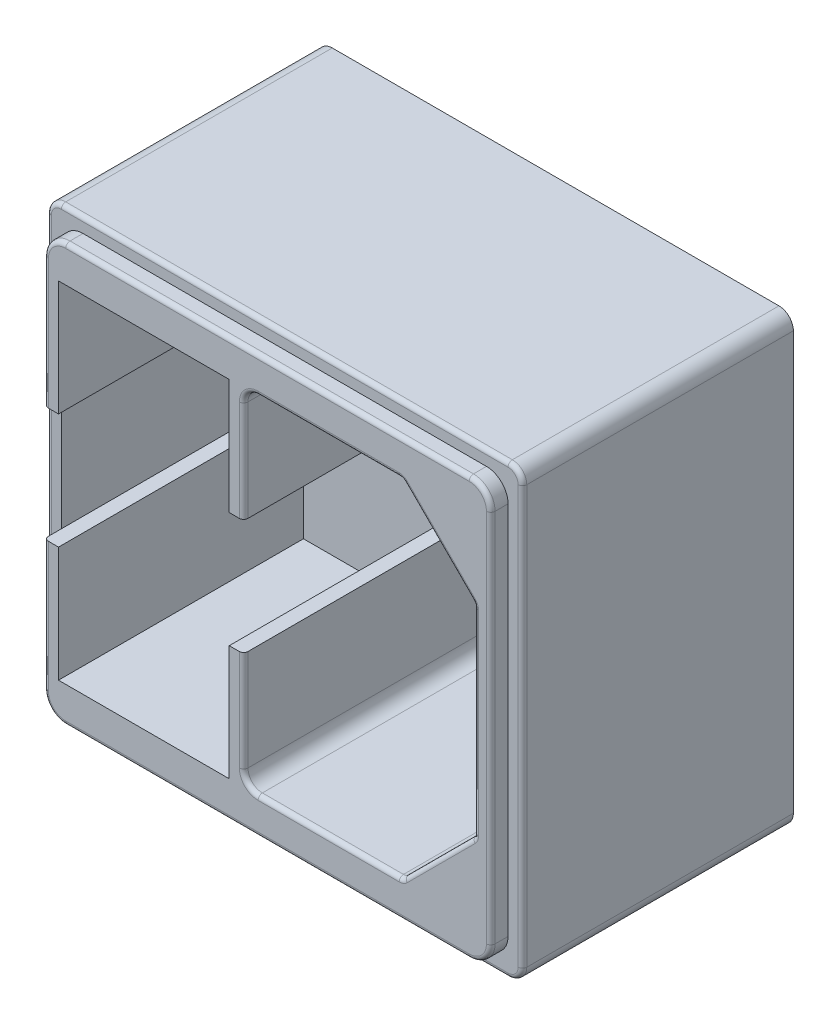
ISO-10303-21;
HEADER;
FILE_DESCRIPTION(('STEP AP214'),'2;1');
FILE_NAME('part.step','',(''),(''),'','','');
FILE_SCHEMA(('AUTOMOTIVE_DESIGN { 1 0 10303 214 1 1 1 1 }'));
ENDSEC;
DATA;
#1=APPLICATION_CONTEXT('core data for automotive mechanical design processes');
#2=APPLICATION_PROTOCOL_DEFINITION('international standard','automotive_design',2000,#1);
#3=PRODUCT_CONTEXT('',#1,'mechanical');
#4=PRODUCT('Part','Part','',(#3));
#5=PRODUCT_RELATED_PRODUCT_CATEGORY('part','',(#4));
#6=PRODUCT_DEFINITION_FORMATION('','',#4);
#7=PRODUCT_DEFINITION_CONTEXT('part definition',#1,'design');
#8=PRODUCT_DEFINITION('design','',#6,#7);
#9=PRODUCT_DEFINITION_SHAPE('','',#8);
#10=(LENGTH_UNIT() NAMED_UNIT(*) SI_UNIT(.MILLI.,.METRE.));
#11=(NAMED_UNIT(*) PLANE_ANGLE_UNIT() SI_UNIT($,.RADIAN.));
#12=(NAMED_UNIT(*) SI_UNIT($,.STERADIAN.) SOLID_ANGLE_UNIT());
#13=UNCERTAINTY_MEASURE_WITH_UNIT(LENGTH_MEASURE(1.E-05),#10,'distance_accuracy_value','');
#14=(GEOMETRIC_REPRESENTATION_CONTEXT(3) GLOBAL_UNCERTAINTY_ASSIGNED_CONTEXT((#13)) GLOBAL_UNIT_ASSIGNED_CONTEXT((#10,
#11,#12)) REPRESENTATION_CONTEXT('',''));
#15=CARTESIAN_POINT('',(0.,0.,0.));
#16=DIRECTION('',(0.,0.,1.));
#17=DIRECTION('',(1.,0.,0.));
#18=AXIS2_PLACEMENT_3D('',#15,#16,#17);
#19=CARTESIAN_POINT('',(1.,30.,20.));
#20=DIRECTION('',(0.,0.,-1.));
#21=DIRECTION('',(-1.,0.,0.));
#22=AXIS2_PLACEMENT_3D('',#19,#20,#21);
#23=CYLINDRICAL_SURFACE('',#22,1.);
#24=DIRECTION('',(0.,0.,-1.));
#25=VECTOR('',#24,1.);
#26=CARTESIAN_POINT('',(0.,30.,20.));
#27=LINE('',#26,#25);
#28=CARTESIAN_POINT('',(0.,30.,18.5));
#29=VERTEX_POINT('',#28);
#30=CARTESIAN_POINT('',(0.,30.,0.));
#31=VERTEX_POINT('',#30);
#32=EDGE_CURVE('E827',#29,#31,#27,.T.);
#33=ORIENTED_EDGE('',*,*,#32,.F.);
#34=CARTESIAN_POINT('',(1.,30.,18.5));
#35=DIRECTION('',(0.,0.,1.));
#36=DIRECTION('',(1.,0.,0.));
#37=AXIS2_PLACEMENT_3D('',#34,#35,#36);
#38=CIRCLE('',#37,1.);
#39=CARTESIAN_POINT('',(1.00000000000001,31.,18.5));
#40=VERTEX_POINT('',#39);
#41=EDGE_CURVE('E899',#29,#40,#38,.F.);
#42=ORIENTED_EDGE('',*,*,#41,.T.);
#43=DIRECTION('',(0.,0.,-1.));
#44=VECTOR('',#43,1.);
#45=CARTESIAN_POINT('',(1.00000000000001,31.,20.));
#46=LINE('',#45,#44);
#47=CARTESIAN_POINT('',(1.00000000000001,31.,0.));
#48=VERTEX_POINT('',#47);
#49=EDGE_CURVE('E813',#40,#48,#46,.T.);
#50=ORIENTED_EDGE('',*,*,#49,.T.);
#51=CARTESIAN_POINT('',(1.,30.,0.));
#52=DIRECTION('',(0.,0.,1.));
#53=DIRECTION('',(-1.,0.,0.));
#54=AXIS2_PLACEMENT_3D('',#51,#52,#53);
#55=CIRCLE('',#54,1.);
#56=EDGE_CURVE('E760',#48,#31,#55,.T.);
#57=ORIENTED_EDGE('',*,*,#56,.T.);
#58=EDGE_LOOP('',(#33,#42,#50,#57));
#59=FACE_BOUND('',#58,.T.);
#60=ADVANCED_FACE('F33',(#59),#23,.T.);
#61=CARTESIAN_POINT('',(0.,1.00000000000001,20.));
#62=DIRECTION('',(1.,0.,0.));
#63=DIRECTION('',(0.,0.,-1.));
#64=AXIS2_PLACEMENT_3D('',#61,#62,#63);
#65=PLANE('',#64);
#66=DIRECTION('',(0.,0.,-1.));
#67=VECTOR('',#66,1.);
#68=CARTESIAN_POINT('',(0.,1.00000000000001,20.));
#69=LINE('',#68,#67);
#70=CARTESIAN_POINT('',(0.,1.00000000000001,18.5));
#71=VERTEX_POINT('',#70);
#72=CARTESIAN_POINT('',(0.,1.00000000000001,0.));
#73=VERTEX_POINT('',#72);
#74=EDGE_CURVE('E825',#71,#73,#69,.T.);
#75=ORIENTED_EDGE('',*,*,#74,.F.);
#76=DIRECTION('',(0.,-1.,0.));
#77=VECTOR('',#76,1.);
#78=CARTESIAN_POINT('',(0.,30.,18.5));
#79=LINE('',#78,#77);
#80=EDGE_CURVE('E897',#71,#29,#79,.F.);
#81=ORIENTED_EDGE('',*,*,#80,.T.);
#82=ORIENTED_EDGE('',*,*,#32,.T.);
#83=DIRECTION('',(0.,-1.,0.));
#84=VECTOR('',#83,1.);
#85=CARTESIAN_POINT('',(0.,1.00000000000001,0.));
#86=LINE('',#85,#84);
#87=EDGE_CURVE('E792',#31,#73,#86,.T.);
#88=ORIENTED_EDGE('',*,*,#87,.T.);
#89=EDGE_LOOP('',(#75,#81,#82,#88));
#90=FACE_BOUND('',#89,.T.);
#91=ADVANCED_FACE('F1252',(#90),#65,.F.);
#92=CARTESIAN_POINT('',(1.,1.,20.));
#93=DIRECTION('',(0.,0.,-1.));
#94=DIRECTION('',(-1.,0.,0.));
#95=AXIS2_PLACEMENT_3D('',#92,#93,#94);
#96=CYLINDRICAL_SURFACE('',#95,1.);
#97=DIRECTION('',(0.,0.,-1.));
#98=VECTOR('',#97,1.);
#99=CARTESIAN_POINT('',(1.00000000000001,0.,20.));
#100=LINE('',#99,#98);
#101=CARTESIAN_POINT('',(1.00000000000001,0.,18.5));
#102=VERTEX_POINT('',#101);
#103=CARTESIAN_POINT('',(1.00000000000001,0.,0.));
#104=VERTEX_POINT('',#103);
#105=EDGE_CURVE('E823',#102,#104,#100,.T.);
#106=ORIENTED_EDGE('',*,*,#105,.F.);
#107=CARTESIAN_POINT('',(1.,1.,18.5));
#108=DIRECTION('',(0.,0.,1.));
#109=DIRECTION('',(1.,0.,0.));
#110=AXIS2_PLACEMENT_3D('',#107,#108,#109);
#111=CIRCLE('',#110,1.);
#112=EDGE_CURVE('E895',#102,#71,#111,.F.);
#113=ORIENTED_EDGE('',*,*,#112,.T.);
#114=ORIENTED_EDGE('',*,*,#74,.T.);
#115=CARTESIAN_POINT('',(1.,1.,0.));
#116=DIRECTION('',(0.,0.,1.));
#117=DIRECTION('',(1.,0.,0.));
#118=AXIS2_PLACEMENT_3D('',#115,#116,#117);
#119=CIRCLE('',#118,1.);
#120=EDGE_CURVE('E795',#73,#104,#119,.T.);
#121=ORIENTED_EDGE('',*,*,#120,.T.);
#122=EDGE_LOOP('',(#106,#113,#114,#121));
#123=FACE_BOUND('',#122,.T.);
#124=ADVANCED_FACE('F1257',(#123),#96,.T.);
#125=CARTESIAN_POINT('',(1.00000000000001,0.,20.));
#126=DIRECTION('',(0.,1.,0.));
#127=DIRECTION('',(0.,0.,1.));
#128=AXIS2_PLACEMENT_3D('',#125,#126,#127);
#129=PLANE('',#128);
#130=DIRECTION('',(0.,0.,-1.));
#131=VECTOR('',#130,1.);
#132=CARTESIAN_POINT('',(32.,0.,20.));
#133=LINE('',#132,#131);
#134=CARTESIAN_POINT('',(32.,0.,18.5));
#135=VERTEX_POINT('',#134);
#136=CARTESIAN_POINT('',(32.,0.,0.));
#137=VERTEX_POINT('',#136);
#138=EDGE_CURVE('E821',#135,#137,#133,.T.);
#139=ORIENTED_EDGE('',*,*,#138,.F.);
#140=DIRECTION('',(1.,0.,0.));
#141=VECTOR('',#140,1.);
#142=CARTESIAN_POINT('',(1.00000000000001,0.,18.5));
#143=LINE('',#142,#141);
#144=EDGE_CURVE('E893',#135,#102,#143,.F.);
#145=ORIENTED_EDGE('',*,*,#144,.T.);
#146=ORIENTED_EDGE('',*,*,#105,.T.);
#147=DIRECTION('',(1.,0.,0.));
#148=VECTOR('',#147,1.);
#149=CARTESIAN_POINT('',(1.00000000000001,0.,0.));
#150=LINE('',#149,#148);
#151=EDGE_CURVE('E798',#104,#137,#150,.T.);
#152=ORIENTED_EDGE('',*,*,#151,.T.);
#153=EDGE_LOOP('',(#139,#145,#146,#152));
#154=FACE_BOUND('',#153,.T.);
#155=ADVANCED_FACE('F1316',(#154),#129,.F.);
#156=CARTESIAN_POINT('',(32.,1.,20.));
#157=DIRECTION('',(0.,0.,-1.));
#158=DIRECTION('',(-1.,0.,0.));
#159=AXIS2_PLACEMENT_3D('',#156,#157,#158);
#160=CYLINDRICAL_SURFACE('',#159,1.);
#161=DIRECTION('',(0.,0.,-1.));
#162=VECTOR('',#161,1.);
#163=CARTESIAN_POINT('',(33.,1.00000000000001,20.));
#164=LINE('',#163,#162);
#165=CARTESIAN_POINT('',(33.,1.00000000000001,18.5));
#166=VERTEX_POINT('',#165);
#167=CARTESIAN_POINT('',(33.,1.00000000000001,0.));
#168=VERTEX_POINT('',#167);
#169=EDGE_CURVE('E819',#166,#168,#164,.T.);
#170=ORIENTED_EDGE('',*,*,#169,.F.);
#171=CARTESIAN_POINT('',(32.,1.,18.5));
#172=DIRECTION('',(0.,0.,1.));
#173=DIRECTION('',(1.,0.,0.));
#174=AXIS2_PLACEMENT_3D('',#171,#172,#173);
#175=CIRCLE('',#174,1.);
#176=EDGE_CURVE('E891',#166,#135,#175,.F.);
#177=ORIENTED_EDGE('',*,*,#176,.T.);
#178=ORIENTED_EDGE('',*,*,#138,.T.);
#179=CARTESIAN_POINT('',(32.,1.,0.));
#180=DIRECTION('',(0.,0.,1.));
#181=DIRECTION('',(1.,0.,0.));
#182=AXIS2_PLACEMENT_3D('',#179,#180,#181);
#183=CIRCLE('',#182,1.);
#184=EDGE_CURVE('E801',#137,#168,#183,.T.);
#185=ORIENTED_EDGE('',*,*,#184,.T.);
#186=EDGE_LOOP('',(#170,#177,#178,#185));
#187=FACE_BOUND('',#186,.T.);
#188=ADVANCED_FACE('F1301',(#187),#160,.T.);
#189=CARTESIAN_POINT('',(33.,1.00000000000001,20.));
#190=DIRECTION('',(-1.,0.,0.));
#191=DIRECTION('',(0.,0.,1.));
#192=AXIS2_PLACEMENT_3D('',#189,#190,#191);
#193=PLANE('',#192);
#194=DIRECTION('',(0.,0.,-1.));
#195=VECTOR('',#194,1.);
#196=CARTESIAN_POINT('',(33.,30.,20.));
#197=LINE('',#196,#195);
#198=CARTESIAN_POINT('',(33.,30.,18.5));
#199=VERTEX_POINT('',#198);
#200=CARTESIAN_POINT('',(33.,30.,0.));
#201=VERTEX_POINT('',#200);
#202=EDGE_CURVE('E817',#199,#201,#197,.T.);
#203=ORIENTED_EDGE('',*,*,#202,.F.);
#204=DIRECTION('',(0.,1.,0.));
#205=VECTOR('',#204,1.);
#206=CARTESIAN_POINT('',(33.,1.00000000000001,18.5));
#207=LINE('',#206,#205);
#208=EDGE_CURVE('E889',#199,#166,#207,.F.);
#209=ORIENTED_EDGE('',*,*,#208,.T.);
#210=ORIENTED_EDGE('',*,*,#169,.T.);
#211=DIRECTION('',(0.,1.,0.));
#212=VECTOR('',#211,1.);
#213=CARTESIAN_POINT('',(33.,1.00000000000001,0.));
#214=LINE('',#213,#212);
#215=EDGE_CURVE('E804',#168,#201,#214,.T.);
#216=ORIENTED_EDGE('',*,*,#215,.T.);
#217=EDGE_LOOP('',(#203,#209,#210,#216));
#218=FACE_BOUND('',#217,.T.);
#219=ADVANCED_FACE('F1298',(#218),#193,.F.);
#220=CARTESIAN_POINT('',(32.,30.,20.));
#221=DIRECTION('',(0.,0.,-1.));
#222=DIRECTION('',(-1.,0.,0.));
#223=AXIS2_PLACEMENT_3D('',#220,#221,#222);
#224=CYLINDRICAL_SURFACE('',#223,1.);
#225=DIRECTION('',(0.,0.,-1.));
#226=VECTOR('',#225,1.);
#227=CARTESIAN_POINT('',(32.,31.,20.));
#228=LINE('',#227,#226);
#229=CARTESIAN_POINT('',(32.,31.,18.5));
#230=VERTEX_POINT('',#229);
#231=CARTESIAN_POINT('',(32.,31.,0.));
#232=VERTEX_POINT('',#231);
#233=EDGE_CURVE('E815',#230,#232,#228,.T.);
#234=ORIENTED_EDGE('',*,*,#233,.F.);
#235=CARTESIAN_POINT('',(32.,30.,18.5));
#236=DIRECTION('',(0.,0.,1.));
#237=DIRECTION('',(1.,0.,0.));
#238=AXIS2_PLACEMENT_3D('',#235,#236,#237);
#239=CIRCLE('',#238,1.);
#240=EDGE_CURVE('E886',#230,#199,#239,.F.);
#241=ORIENTED_EDGE('',*,*,#240,.T.);
#242=ORIENTED_EDGE('',*,*,#202,.T.);
#243=CARTESIAN_POINT('',(32.,30.,0.));
#244=DIRECTION('',(0.,0.,1.));
#245=DIRECTION('',(1.,0.,0.));
#246=AXIS2_PLACEMENT_3D('',#243,#244,#245);
#247=CIRCLE('',#246,1.);
#248=EDGE_CURVE('E807',#201,#232,#247,.T.);
#249=ORIENTED_EDGE('',*,*,#248,.T.);
#250=EDGE_LOOP('',(#234,#241,#242,#249));
#251=FACE_BOUND('',#250,.T.);
#252=ADVANCED_FACE('F1283',(#251),#224,.T.);
#253=CARTESIAN_POINT('',(1.00000000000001,31.,20.));
#254=DIRECTION('',(0.,-1.,0.));
#255=DIRECTION('',(0.,0.,-1.));
#256=AXIS2_PLACEMENT_3D('',#253,#254,#255);
#257=PLANE('',#256);
#258=ORIENTED_EDGE('',*,*,#49,.F.);
#259=DIRECTION('',(-1.,0.,0.));
#260=VECTOR('',#259,1.);
#261=CARTESIAN_POINT('',(32.,31.,18.5));
#262=LINE('',#261,#260);
#263=EDGE_CURVE('E901',#40,#230,#262,.F.);
#264=ORIENTED_EDGE('',*,*,#263,.T.);
#265=ORIENTED_EDGE('',*,*,#233,.T.);
#266=DIRECTION('',(-1.,0.,0.));
#267=VECTOR('',#266,1.);
#268=CARTESIAN_POINT('',(1.00000000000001,31.,0.));
#269=LINE('',#268,#267);
#270=EDGE_CURVE('E810',#232,#48,#269,.T.);
#271=ORIENTED_EDGE('',*,*,#270,.T.);
#272=EDGE_LOOP('',(#258,#264,#265,#271));
#273=FACE_BOUND('',#272,.T.);
#274=ADVANCED_FACE('F1280',(#273),#257,.F.);
#275=CARTESIAN_POINT('',(1.,30.,20.));
#276=DIRECTION('',(0.,0.,-1.));
#277=DIRECTION('',(-1.,0.,0.));
#278=AXIS2_PLACEMENT_3D('',#275,#276,#277);
#279=PLANE('',#278);
#280=CARTESIAN_POINT('',(15.8491167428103,4.5,20.));
#281=DIRECTION('',(0.,0.,-1.));
#282=DIRECTION('',(-1.,0.,0.));
#283=AXIS2_PLACEMENT_3D('',#280,#281,#282);
#284=CIRCLE('',#283,1.3);
#285=CARTESIAN_POINT('',(15.8491167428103,3.19999999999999,20.));
#286=VERTEX_POINT('',#285);
#287=CARTESIAN_POINT('',(14.5491167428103,4.5,20.));
#288=VERTEX_POINT('',#287);
#289=EDGE_CURVE('E928',#286,#288,#284,.T.);
#290=ORIENTED_EDGE('',*,*,#289,.T.);
#291=DIRECTION('',(0.,-1.,0.));
#292=VECTOR('',#291,1.);
#293=CARTESIAN_POINT('',(14.5491167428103,30.,20.));
#294=LINE('',#293,#292);
#295=CARTESIAN_POINT('',(14.5491167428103,11.5,20.));
#296=VERTEX_POINT('',#295);
#297=EDGE_CURVE('E930',#288,#296,#294,.F.);
#298=ORIENTED_EDGE('',*,*,#297,.T.);
#299=DIRECTION('',(1.,0.,0.));
#300=VECTOR('',#299,1.);
#301=CARTESIAN_POINT('',(14.8491167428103,11.5,20.));
#302=LINE('',#301,#300);
#303=CARTESIAN_POINT('',(13.8491167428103,11.5,20.));
#304=VERTEX_POINT('',#303);
#305=EDGE_CURVE('E543',#304,#296,#302,.T.);
#306=ORIENTED_EDGE('',*,*,#305,.F.);
#307=DIRECTION('',(0.,1.,0.));
#308=VECTOR('',#307,1.);
#309=CARTESIAN_POINT('',(13.8491167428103,11.5,20.));
#310=LINE('',#309,#308);
#311=CARTESIAN_POINT('',(13.8491167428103,3.5,20.));
#312=VERTEX_POINT('',#311);
#313=EDGE_CURVE('E540',#312,#304,#310,.T.);
#314=ORIENTED_EDGE('',*,*,#313,.F.);
#315=DIRECTION('',(1.,0.,0.));
#316=VECTOR('',#315,1.);
#317=CARTESIAN_POINT('',(13.8491167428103,3.5,20.));
#318=LINE('',#317,#316);
#319=CARTESIAN_POINT('',(2.,3.5,20.));
#320=VERTEX_POINT('',#319);
#321=EDGE_CURVE('E537',#320,#312,#318,.T.);
#322=ORIENTED_EDGE('',*,*,#321,.F.);
#323=DIRECTION('',(0.,-1.,0.));
#324=VECTOR('',#323,1.);
#325=CARTESIAN_POINT('',(2.,11.5,20.));
#326=LINE('',#325,#324);
#327=CARTESIAN_POINT('',(2.,11.5,20.));
#328=VERTEX_POINT('',#327);
#329=EDGE_CURVE('E534',#328,#320,#326,.T.);
#330=ORIENTED_EDGE('',*,*,#329,.F.);
#331=DIRECTION('',(1.,0.,0.));
#332=VECTOR('',#331,1.);
#333=CARTESIAN_POINT('',(2.,11.5,20.));
#334=LINE('',#333,#332);
#335=CARTESIAN_POINT('',(1.3,11.5,20.));
#336=VERTEX_POINT('',#335);
#337=EDGE_CURVE('E532',#336,#328,#334,.T.);
#338=ORIENTED_EDGE('',*,*,#337,.F.);
#339=DIRECTION('',(0.,-1.,0.));
#340=VECTOR('',#339,1.);
#341=CARTESIAN_POINT('',(1.3,2.50000000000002,20.));
#342=LINE('',#341,#340);
#343=CARTESIAN_POINT('',(1.3,2.50000000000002,20.));
#344=VERTEX_POINT('',#343);
#345=EDGE_CURVE('E845',#336,#344,#342,.T.);
#346=ORIENTED_EDGE('',*,*,#345,.T.);
#347=CARTESIAN_POINT('',(2.5,2.50000000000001,20.));
#348=DIRECTION('',(0.,0.,-1.));
#349=DIRECTION('',(-1.,0.,0.));
#350=AXIS2_PLACEMENT_3D('',#347,#348,#349);
#351=CIRCLE('',#350,1.2);
#352=CARTESIAN_POINT('',(2.50000000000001,1.30000000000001,20.));
#353=VERTEX_POINT('',#352);
#354=EDGE_CURVE('E843',#344,#353,#351,.F.);
#355=ORIENTED_EDGE('',*,*,#354,.T.);
#356=DIRECTION('',(1.,0.,0.));
#357=VECTOR('',#356,1.);
#358=CARTESIAN_POINT('',(30.5,1.30000000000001,20.));
#359=LINE('',#358,#357);
#360=CARTESIAN_POINT('',(30.5,1.30000000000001,20.));
#361=VERTEX_POINT('',#360);
#362=EDGE_CURVE('E841',#353,#361,#359,.T.);
#363=ORIENTED_EDGE('',*,*,#362,.T.);
#364=CARTESIAN_POINT('',(30.5,2.50000000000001,20.));
#365=DIRECTION('',(0.,0.,-1.));
#366=DIRECTION('',(-1.,0.,0.));
#367=AXIS2_PLACEMENT_3D('',#364,#365,#366);
#368=CIRCLE('',#367,1.2);
#369=CARTESIAN_POINT('',(31.7,2.50000000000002,20.));
#370=VERTEX_POINT('',#369);
#371=EDGE_CURVE('E839',#361,#370,#368,.F.);
#372=ORIENTED_EDGE('',*,*,#371,.T.);
#373=DIRECTION('',(0.,1.,0.));
#374=VECTOR('',#373,1.);
#375=CARTESIAN_POINT('',(31.7,28.5,20.));
#376=LINE('',#375,#374);
#377=CARTESIAN_POINT('',(31.7,28.5,20.));
#378=VERTEX_POINT('',#377);
#379=EDGE_CURVE('E837',#370,#378,#376,.T.);
#380=ORIENTED_EDGE('',*,*,#379,.T.);
#381=CARTESIAN_POINT('',(30.5,28.5,20.));
#382=DIRECTION('',(0.,0.,-1.));
#383=DIRECTION('',(-1.,0.,0.));
#384=AXIS2_PLACEMENT_3D('',#381,#382,#383);
#385=CIRCLE('',#384,1.2);
#386=CARTESIAN_POINT('',(30.5,29.7,20.));
#387=VERTEX_POINT('',#386);
#388=EDGE_CURVE('E835',#378,#387,#385,.F.);
#389=ORIENTED_EDGE('',*,*,#388,.T.);
#390=DIRECTION('',(-1.,0.,0.));
#391=VECTOR('',#390,1.);
#392=CARTESIAN_POINT('',(2.50000000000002,29.7,20.));
#393=LINE('',#392,#391);
#394=CARTESIAN_POINT('',(2.50000000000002,29.7,20.));
#395=VERTEX_POINT('',#394);
#396=EDGE_CURVE('E829',#387,#395,#393,.T.);
#397=ORIENTED_EDGE('',*,*,#396,.T.);
#398=CARTESIAN_POINT('',(2.50000000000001,28.5,20.));
#399=DIRECTION('',(0.,0.,-1.));
#400=DIRECTION('',(-1.,0.,0.));
#401=AXIS2_PLACEMENT_3D('',#398,#399,#400);
#402=CIRCLE('',#401,1.2);
#403=CARTESIAN_POINT('',(1.30000000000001,28.5,20.));
#404=VERTEX_POINT('',#403);
#405=EDGE_CURVE('E831',#395,#404,#402,.F.);
#406=ORIENTED_EDGE('',*,*,#405,.T.);
#407=DIRECTION('',(0.,-1.,0.));
#408=VECTOR('',#407,1.);
#409=CARTESIAN_POINT('',(1.3,19.5,20.));
#410=LINE('',#409,#408);
#411=CARTESIAN_POINT('',(1.3,19.5,20.));
#412=VERTEX_POINT('',#411);
#413=EDGE_CURVE('E833',#404,#412,#410,.T.);
#414=ORIENTED_EDGE('',*,*,#413,.T.);
#415=DIRECTION('',(-1.,0.,0.));
#416=VECTOR('',#415,1.);
#417=CARTESIAN_POINT('',(2.,19.5,20.));
#418=LINE('',#417,#416);
#419=CARTESIAN_POINT('',(2.,19.5,20.));
#420=VERTEX_POINT('',#419);
#421=EDGE_CURVE('E557',#420,#412,#418,.T.);
#422=ORIENTED_EDGE('',*,*,#421,.F.);
#423=DIRECTION('',(0.,-1.,0.));
#424=VECTOR('',#423,1.);
#425=CARTESIAN_POINT('',(2.,27.5,20.));
#426=LINE('',#425,#424);
#427=CARTESIAN_POINT('',(2.,27.5,20.));
#428=VERTEX_POINT('',#427);
#429=EDGE_CURVE('E554',#428,#420,#426,.T.);
#430=ORIENTED_EDGE('',*,*,#429,.F.);
#431=DIRECTION('',(-1.,0.,0.));
#432=VECTOR('',#431,1.);
#433=CARTESIAN_POINT('',(13.8491167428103,27.5,20.));
#434=LINE('',#433,#432);
#435=CARTESIAN_POINT('',(13.8491167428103,27.5,20.));
#436=VERTEX_POINT('',#435);
#437=EDGE_CURVE('E551',#436,#428,#434,.T.);
#438=ORIENTED_EDGE('',*,*,#437,.F.);
#439=DIRECTION('',(0.,1.,0.));
#440=VECTOR('',#439,1.);
#441=CARTESIAN_POINT('',(13.8491167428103,27.5,20.));
#442=LINE('',#441,#440);
#443=CARTESIAN_POINT('',(13.8491167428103,19.5,20.));
#444=VERTEX_POINT('',#443);
#445=EDGE_CURVE('E548',#444,#436,#442,.T.);
#446=ORIENTED_EDGE('',*,*,#445,.F.);
#447=DIRECTION('',(-1.,0.,0.));
#448=VECTOR('',#447,1.);
#449=CARTESIAN_POINT('',(14.8491167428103,19.5,20.));
#450=LINE('',#449,#448);
#451=CARTESIAN_POINT('',(14.5491167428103,19.5,20.));
#452=VERTEX_POINT('',#451);
#453=EDGE_CURVE('E546',#452,#444,#450,.T.);
#454=ORIENTED_EDGE('',*,*,#453,.F.);
#455=DIRECTION('',(0.,-1.,0.));
#456=VECTOR('',#455,1.);
#457=CARTESIAN_POINT('',(14.5491167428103,30.,20.));
#458=LINE('',#457,#456);
#459=CARTESIAN_POINT('',(14.5491167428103,26.5,20.));
#460=VERTEX_POINT('',#459);
#461=EDGE_CURVE('E914',#452,#460,#458,.F.);
#462=ORIENTED_EDGE('',*,*,#461,.T.);
#463=CARTESIAN_POINT('',(15.8491167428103,26.5,20.));
#464=DIRECTION('',(0.,0.,-1.));
#465=DIRECTION('',(-1.,0.,0.));
#466=AXIS2_PLACEMENT_3D('',#463,#464,#465);
#467=CIRCLE('',#466,1.3);
#468=CARTESIAN_POINT('',(15.8491167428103,27.8,20.));
#469=VERTEX_POINT('',#468);
#470=EDGE_CURVE('E912',#460,#469,#467,.T.);
#471=ORIENTED_EDGE('',*,*,#470,.T.);
#472=DIRECTION('',(-1.,0.,0.));
#473=VECTOR('',#472,1.);
#474=CARTESIAN_POINT('',(1.,27.8,20.));
#475=LINE('',#474,#473);
#476=CARTESIAN_POINT('',(25.6420099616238,27.8,20.));
#477=VERTEX_POINT('',#476);
#478=EDGE_CURVE('E910',#469,#477,#475,.F.);
#479=ORIENTED_EDGE('',*,*,#478,.T.);
#480=CARTESIAN_POINT('',(25.6420099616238,27.,20.));
#481=DIRECTION('',(0.,0.,-1.));
#482=DIRECTION('',(-1.,0.,0.));
#483=AXIS2_PLACEMENT_3D('',#480,#481,#482);
#484=CIRCLE('',#483,0.799999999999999);
#485=CARTESIAN_POINT('',(26.207695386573,27.5656854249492,20.));
#486=VERTEX_POINT('',#485);
#487=EDGE_CURVE('E908',#477,#486,#484,.T.);
#488=ORIENTED_EDGE('',*,*,#487,.T.);
#489=DIRECTION('',(-0.707106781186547,0.707106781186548,0.));
#490=VECTOR('',#489,1.);
#491=CARTESIAN_POINT('',(12.3866904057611,41.3866904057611,20.));
#492=LINE('',#491,#490);
#493=CARTESIAN_POINT('',(30.9148021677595,22.8585786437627,20.));
#494=VERTEX_POINT('',#493);
#495=EDGE_CURVE('E906',#486,#494,#492,.F.);
#496=ORIENTED_EDGE('',*,*,#495,.T.);
#497=CARTESIAN_POINT('',(30.3491167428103,22.2928932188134,20.));
#498=DIRECTION('',(0.,0.,-1.));
#499=DIRECTION('',(-1.,0.,0.));
#500=AXIS2_PLACEMENT_3D('',#497,#498,#499);
#501=CIRCLE('',#500,0.799999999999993);
#502=CARTESIAN_POINT('',(31.1491167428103,22.2928932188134,20.));
#503=VERTEX_POINT('',#502);
#504=EDGE_CURVE('E916',#494,#503,#501,.T.);
#505=ORIENTED_EDGE('',*,*,#504,.T.);
#506=DIRECTION('',(0.,1.,0.));
#507=VECTOR('',#506,1.);
#508=CARTESIAN_POINT('',(31.1491167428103,30.,20.));
#509=LINE('',#508,#507);
#510=CARTESIAN_POINT('',(31.1491167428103,8.70710678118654,20.));
#511=VERTEX_POINT('',#510);
#512=EDGE_CURVE('E918',#503,#511,#509,.F.);
#513=ORIENTED_EDGE('',*,*,#512,.T.);
#514=CARTESIAN_POINT('',(30.3491167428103,8.70710678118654,20.));
#515=DIRECTION('',(0.,0.,-1.));
#516=DIRECTION('',(-1.,0.,0.));
#517=AXIS2_PLACEMENT_3D('',#514,#515,#516);
#518=CIRCLE('',#517,0.799999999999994);
#519=CARTESIAN_POINT('',(30.9148021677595,8.14142135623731,20.));
#520=VERTEX_POINT('',#519);
#521=EDGE_CURVE('E920',#511,#520,#518,.T.);
#522=ORIENTED_EDGE('',*,*,#521,.T.);
#523=DIRECTION('',(0.707106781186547,0.707106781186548,0.));
#524=VECTOR('',#523,1.);
#525=CARTESIAN_POINT('',(26.8866904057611,4.11330959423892,20.));
#526=LINE('',#525,#524);
#527=CARTESIAN_POINT('',(26.207695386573,3.43431457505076,20.));
#528=VERTEX_POINT('',#527);
#529=EDGE_CURVE('E922',#520,#528,#526,.F.);
#530=ORIENTED_EDGE('',*,*,#529,.T.);
#531=CARTESIAN_POINT('',(25.6420099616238,4.,20.));
#532=DIRECTION('',(0.,0.,-1.));
#533=DIRECTION('',(-1.,0.,0.));
#534=AXIS2_PLACEMENT_3D('',#531,#532,#533);
#535=CIRCLE('',#534,0.800000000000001);
#536=CARTESIAN_POINT('',(25.6420099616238,3.2,20.));
#537=VERTEX_POINT('',#536);
#538=EDGE_CURVE('E924',#528,#537,#535,.T.);
#539=ORIENTED_EDGE('',*,*,#538,.T.);
#540=DIRECTION('',(1.,0.,0.));
#541=VECTOR('',#540,1.);
#542=CARTESIAN_POINT('',(1.,3.19999999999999,20.));
#543=LINE('',#542,#541);
#544=EDGE_CURVE('E926',#537,#286,#543,.F.);
#545=ORIENTED_EDGE('',*,*,#544,.T.);
#546=EDGE_LOOP('',(#290,#298,#306,#314,#322,#330,#338,#346,#355,#363,#372,#380,#389,#397,#406,
#414,#422,#430,#438,#446,#454,#462,#471,#479,#488,#496,#505,#513,#522,#530,#539,#545));
#547=FACE_BOUND('',#546,.T.);
#548=ADVANCED_FACE('F1035',(#547),#279,.F.);
#549=CARTESIAN_POINT('',(1.,19.5,3.));
#550=DIRECTION('',(-1.,0.,0.));
#551=DIRECTION('',(0.,0.,1.));
#552=AXIS2_PLACEMENT_3D('',#549,#550,#551);
#553=PLANE('',#552);
#554=DIRECTION('',(0.,-1.,0.));
#555=VECTOR('',#554,1.);
#556=CARTESIAN_POINT('',(1.00000000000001,28.5,18.8));
#557=LINE('',#556,#555);
#558=CARTESIAN_POINT('',(1.,19.5,18.8));
#559=VERTEX_POINT('',#558);
#560=CARTESIAN_POINT('',(1.,11.5,18.8));
#561=VERTEX_POINT('',#560);
#562=EDGE_CURVE('E482',#559,#561,#557,.T.);
#563=ORIENTED_EDGE('',*,*,#562,.T.);
#564=DIRECTION('',(0.,0.,1.));
#565=VECTOR('',#564,1.);
#566=CARTESIAN_POINT('',(1.,11.5,3.));
#567=LINE('',#566,#565);
#568=CARTESIAN_POINT('',(1.,11.5,3.));
#569=VERTEX_POINT('',#568);
#570=EDGE_CURVE('E593',#569,#561,#567,.T.);
#571=ORIENTED_EDGE('',*,*,#570,.F.);
#572=DIRECTION('',(0.,-1.,0.));
#573=VECTOR('',#572,1.);
#574=CARTESIAN_POINT('',(1.,19.5,3.));
#575=LINE('',#574,#573);
#576=CARTESIAN_POINT('',(1.,19.5,3.));
#577=VERTEX_POINT('',#576);
#578=EDGE_CURVE('E589',#577,#569,#575,.T.);
#579=ORIENTED_EDGE('',*,*,#578,.F.);
#580=DIRECTION('',(0.,0.,1.));
#581=VECTOR('',#580,1.);
#582=CARTESIAN_POINT('',(1.,19.5,3.));
#583=LINE('',#582,#581);
#584=EDGE_CURVE('E597',#577,#559,#583,.T.);
#585=ORIENTED_EDGE('',*,*,#584,.T.);
#586=EDGE_LOOP('',(#563,#571,#579,#585));
#587=FACE_BOUND('',#586,.T.);
#588=ADVANCED_FACE('F1213',(#587),#553,.F.);
#589=CARTESIAN_POINT('',(14.8491167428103,26.5,3.));
#590=DIRECTION('',(-1.,0.,0.));
#591=DIRECTION('',(0.,0.,1.));
#592=AXIS2_PLACEMENT_3D('',#589,#590,#591);
#593=PLANE('',#592);
#594=DIRECTION('',(0.,0.,1.));
#595=VECTOR('',#594,1.);
#596=CARTESIAN_POINT('',(14.8491167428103,26.5,3.));
#597=LINE('',#596,#595);
#598=CARTESIAN_POINT('',(14.8491167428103,26.5,3.));
#599=VERTEX_POINT('',#598);
#600=CARTESIAN_POINT('',(14.8491167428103,26.5,19.7));
#601=VERTEX_POINT('',#600);
#602=EDGE_CURVE('E756',#599,#601,#597,.T.);
#603=ORIENTED_EDGE('',*,*,#602,.T.);
#604=DIRECTION('',(0.,-1.,0.));
#605=VECTOR('',#604,1.);
#606=CARTESIAN_POINT('',(14.8491167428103,26.5,19.7));
#607=LINE('',#606,#605);
#608=CARTESIAN_POINT('',(14.8491167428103,19.5,19.7));
#609=VERTEX_POINT('',#608);
#610=EDGE_CURVE('E948',#601,#609,#607,.T.);
#611=ORIENTED_EDGE('',*,*,#610,.T.);
#612=DIRECTION('',(0.,0.,1.));
#613=VECTOR('',#612,1.);
#614=CARTESIAN_POINT('',(14.8491167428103,19.5,3.));
#615=LINE('',#614,#613);
#616=CARTESIAN_POINT('',(14.8491167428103,19.5,3.));
#617=VERTEX_POINT('',#616);
#618=EDGE_CURVE('E610',#617,#609,#615,.T.);
#619=ORIENTED_EDGE('',*,*,#618,.F.);
#620=DIRECTION('',(0.,-1.,0.));
#621=VECTOR('',#620,1.);
#622=CARTESIAN_POINT('',(14.8491167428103,26.5,3.));
#623=LINE('',#622,#621);
#624=EDGE_CURVE('E723',#599,#617,#623,.T.);
#625=ORIENTED_EDGE('',*,*,#624,.F.);
#626=EDGE_LOOP('',(#603,#611,#619,#625));
#627=FACE_BOUND('',#626,.T.);
#628=ADVANCED_FACE('F1221',(#627),#593,.F.);
#629=CARTESIAN_POINT('',(1.,30.,0.));
#630=DIRECTION('',(0.,0.,-1.));
#631=DIRECTION('',(-1.,0.,0.));
#632=AXIS2_PLACEMENT_3D('',#629,#630,#631);
#633=PLANE('',#632);
#634=DIRECTION('',(0.,1.,0.));
#635=VECTOR('',#634,1.);
#636=CARTESIAN_POINT('',(30.4358974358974,16.3,0.));
#637=LINE('',#636,#635);
#638=CARTESIAN_POINT('',(30.4358974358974,14.7,0.));
#639=VERTEX_POINT('',#638);
#640=CARTESIAN_POINT('',(30.4358974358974,16.3,0.));
#641=VERTEX_POINT('',#640);
#642=EDGE_CURVE('E629',#639,#641,#637,.T.);
#643=ORIENTED_EDGE('',*,*,#642,.T.);
#644=DIRECTION('',(-1.,0.,0.));
#645=VECTOR('',#644,1.);
#646=CARTESIAN_POINT('',(30.4358974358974,16.3,0.));
#647=LINE('',#646,#645);
#648=CARTESIAN_POINT('',(26.4358974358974,16.3,0.));
#649=VERTEX_POINT('',#648);
#650=EDGE_CURVE('E646',#641,#649,#647,.T.);
#651=ORIENTED_EDGE('',*,*,#650,.T.);
#652=DIRECTION('',(0.,-1.,0.));
#653=VECTOR('',#652,1.);
#654=CARTESIAN_POINT('',(26.4358974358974,16.3,0.));
#655=LINE('',#654,#653);
#656=CARTESIAN_POINT('',(26.4358974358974,14.7,0.));
#657=VERTEX_POINT('',#656);
#658=EDGE_CURVE('E596',#649,#657,#655,.T.);
#659=ORIENTED_EDGE('',*,*,#658,.T.);
#660=DIRECTION('',(1.,0.,0.));
#661=VECTOR('',#660,1.);
#662=CARTESIAN_POINT('',(30.4358974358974,14.7,0.));
#663=LINE('',#662,#661);
#664=EDGE_CURVE('E626',#657,#639,#663,.T.);
#665=ORIENTED_EDGE('',*,*,#664,.T.);
#666=EDGE_LOOP('',(#643,#651,#659,#665));
#667=FACE_BOUND('',#666,.T.);
#668=DIRECTION('',(0.,1.,0.));
#669=VECTOR('',#668,1.);
#670=CARTESIAN_POINT('',(22.400759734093,6.51130104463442,0.));
#671=LINE('',#670,#669);
#672=CARTESIAN_POINT('',(22.400759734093,4.91130104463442,0.));
#673=VERTEX_POINT('',#672);
#674=CARTESIAN_POINT('',(22.400759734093,6.51130104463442,0.));
#675=VERTEX_POINT('',#674);
#676=EDGE_CURVE('E661',#673,#675,#671,.T.);
#677=ORIENTED_EDGE('',*,*,#676,.T.);
#678=DIRECTION('',(-1.,0.,0.));
#679=VECTOR('',#678,1.);
#680=CARTESIAN_POINT('',(18.400759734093,6.51130104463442,0.));
#681=LINE('',#680,#679);
#682=CARTESIAN_POINT('',(18.400759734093,6.51130104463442,0.));
#683=VERTEX_POINT('',#682);
#684=EDGE_CURVE('E678',#675,#683,#681,.T.);
#685=ORIENTED_EDGE('',*,*,#684,.T.);
#686=DIRECTION('',(0.,-1.,0.));
#687=VECTOR('',#686,1.);
#688=CARTESIAN_POINT('',(18.400759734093,6.51130104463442,0.));
#689=LINE('',#688,#687);
#690=CARTESIAN_POINT('',(18.400759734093,4.91130104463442,0.));
#691=VERTEX_POINT('',#690);
#692=EDGE_CURVE('E655',#683,#691,#689,.T.);
#693=ORIENTED_EDGE('',*,*,#692,.T.);
#694=DIRECTION('',(1.,0.,0.));
#695=VECTOR('',#694,1.);
#696=CARTESIAN_POINT('',(18.400759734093,4.91130104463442,0.));
#697=LINE('',#696,#695);
#698=EDGE_CURVE('E658',#691,#673,#697,.T.);
#699=ORIENTED_EDGE('',*,*,#698,.T.);
#700=EDGE_LOOP('',(#677,#685,#693,#699));
#701=FACE_BOUND('',#700,.T.);
#702=DIRECTION('',(-1.,0.,0.));
#703=VECTOR('',#702,1.);
#704=CARTESIAN_POINT('',(18.4007597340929,26.0886989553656,0.));
#705=LINE('',#704,#703);
#706=CARTESIAN_POINT('',(22.400759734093,26.0886989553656,0.));
#707=VERTEX_POINT('',#706);
#708=CARTESIAN_POINT('',(18.4007597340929,26.0886989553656,0.));
#709=VERTEX_POINT('',#708);
#710=EDGE_CURVE('E693',#707,#709,#705,.T.);
#711=ORIENTED_EDGE('',*,*,#710,.T.);
#712=DIRECTION('',(0.,-1.,0.));
#713=VECTOR('',#712,1.);
#714=CARTESIAN_POINT('',(18.4007597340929,26.0886989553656,0.));
#715=LINE('',#714,#713);
#716=CARTESIAN_POINT('',(18.4007597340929,24.4886989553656,0.));
#717=VERTEX_POINT('',#716);
#718=EDGE_CURVE('E710',#709,#717,#715,.T.);
#719=ORIENTED_EDGE('',*,*,#718,.T.);
#720=DIRECTION('',(1.,0.,0.));
#721=VECTOR('',#720,1.);
#722=CARTESIAN_POINT('',(18.4007597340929,24.4886989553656,0.));
#723=LINE('',#722,#721);
#724=CARTESIAN_POINT('',(22.400759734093,24.4886989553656,0.));
#725=VERTEX_POINT('',#724);
#726=EDGE_CURVE('E687',#717,#725,#723,.T.);
#727=ORIENTED_EDGE('',*,*,#726,.T.);
#728=DIRECTION('',(0.,1.,0.));
#729=VECTOR('',#728,1.);
#730=CARTESIAN_POINT('',(22.400759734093,26.0886989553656,0.));
#731=LINE('',#730,#729);
#732=EDGE_CURVE('E690',#725,#707,#731,.T.);
#733=ORIENTED_EDGE('',*,*,#732,.T.);
#734=EDGE_LOOP('',(#711,#719,#727,#733));
#735=FACE_BOUND('',#734,.T.);
#736=ORIENTED_EDGE('',*,*,#56,.F.);
#737=ORIENTED_EDGE('',*,*,#270,.F.);
#738=ORIENTED_EDGE('',*,*,#248,.F.);
#739=ORIENTED_EDGE('',*,*,#215,.F.);
#740=ORIENTED_EDGE('',*,*,#184,.F.);
#741=ORIENTED_EDGE('',*,*,#151,.F.);
#742=ORIENTED_EDGE('',*,*,#120,.F.);
#743=ORIENTED_EDGE('',*,*,#87,.F.);
#744=EDGE_LOOP('',(#736,#737,#738,#739,#740,#741,#742,#743));
#745=FACE_BOUND('',#744,.T.);
#746=ADVANCED_FACE('F1710',(#667,#701,#735,#745),#633,.T.);
#747=CARTESIAN_POINT('',(15.8491167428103,26.5,3.));
#748=DIRECTION('',(0.,0.,1.));
#749=DIRECTION('',(1.,0.,0.));
#750=AXIS2_PLACEMENT_3D('',#747,#748,#749);
#751=CYLINDRICAL_SURFACE('',#750,1.);
#752=DIRECTION('',(0.,0.,1.));
#753=VECTOR('',#752,1.);
#754=CARTESIAN_POINT('',(15.8491167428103,27.5,3.));
#755=LINE('',#754,#753);
#756=CARTESIAN_POINT('',(15.8491167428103,27.5,3.));
#757=VERTEX_POINT('',#756);
#758=CARTESIAN_POINT('',(15.8491167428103,27.5,19.7));
#759=VERTEX_POINT('',#758);
#760=EDGE_CURVE('E757',#757,#759,#755,.T.);
#761=ORIENTED_EDGE('',*,*,#760,.T.);
#762=CARTESIAN_POINT('',(15.8491167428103,26.5,19.7));
#763=DIRECTION('',(0.,0.,-1.));
#764=DIRECTION('',(-1.,0.,0.));
#765=AXIS2_PLACEMENT_3D('',#762,#763,#764);
#766=CIRCLE('',#765,1.);
#767=EDGE_CURVE('E952',#759,#601,#766,.F.);
#768=ORIENTED_EDGE('',*,*,#767,.T.);
#769=ORIENTED_EDGE('',*,*,#602,.F.);
#770=CARTESIAN_POINT('',(15.8491167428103,26.5,3.));
#771=DIRECTION('',(0.,0.,1.));
#772=DIRECTION('',(-1.,0.,0.));
#773=AXIS2_PLACEMENT_3D('',#770,#771,#772);
#774=CIRCLE('',#773,1.);
#775=EDGE_CURVE('E719',#757,#599,#774,.T.);
#776=ORIENTED_EDGE('',*,*,#775,.F.);
#777=EDGE_LOOP('',(#761,#768,#769,#776));
#778=FACE_BOUND('',#777,.T.);
#779=ADVANCED_FACE('F966',(#778),#751,.F.);
#780=CARTESIAN_POINT('',(25.6420099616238,27.5,3.));
#781=DIRECTION('',(0.,1.,0.));
#782=DIRECTION('',(0.,0.,1.));
#783=AXIS2_PLACEMENT_3D('',#780,#781,#782);
#784=PLANE('',#783);
#785=DIRECTION('',(0.,0.,1.));
#786=VECTOR('',#785,1.);
#787=CARTESIAN_POINT('',(25.6420099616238,27.5,3.));
#788=LINE('',#787,#786);
#789=CARTESIAN_POINT('',(25.6420099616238,27.5,3.));
#790=VERTEX_POINT('',#789);
#791=CARTESIAN_POINT('',(25.6420099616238,27.5,19.7));
#792=VERTEX_POINT('',#791);
#793=EDGE_CURVE('E761',#790,#792,#788,.T.);
#794=ORIENTED_EDGE('',*,*,#793,.T.);
#795=DIRECTION('',(-1.,0.,0.));
#796=VECTOR('',#795,1.);
#797=CARTESIAN_POINT('',(25.6420099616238,27.5,19.7));
#798=LINE('',#797,#796);
#799=EDGE_CURVE('E954',#792,#759,#798,.T.);
#800=ORIENTED_EDGE('',*,*,#799,.T.);
#801=ORIENTED_EDGE('',*,*,#760,.F.);
#802=DIRECTION('',(-1.,0.,0.));
#803=VECTOR('',#802,1.);
#804=CARTESIAN_POINT('',(25.6420099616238,27.5,3.));
#805=LINE('',#804,#803);
#806=EDGE_CURVE('E753',#790,#757,#805,.T.);
#807=ORIENTED_EDGE('',*,*,#806,.F.);
#808=EDGE_LOOP('',(#794,#800,#801,#807));
#809=FACE_BOUND('',#808,.T.);
#810=ADVANCED_FACE('F957',(#809),#784,.F.);
#811=CARTESIAN_POINT('',(25.6420099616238,27.,3.));
#812=DIRECTION('',(0.,0.,1.));
#813=DIRECTION('',(1.,0.,0.));
#814=AXIS2_PLACEMENT_3D('',#811,#812,#813);
#815=CYLINDRICAL_SURFACE('',#814,0.499999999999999);
#816=DIRECTION('',(0.,0.,1.));
#817=VECTOR('',#816,1.);
#818=CARTESIAN_POINT('',(25.995563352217,27.3535533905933,3.));
#819=LINE('',#818,#817);
#820=CARTESIAN_POINT('',(25.995563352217,27.3535533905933,3.));
#821=VERTEX_POINT('',#820);
#822=CARTESIAN_POINT('',(25.995563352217,27.3535533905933,19.7));
#823=VERTEX_POINT('',#822);
#824=EDGE_CURVE('E763',#821,#823,#819,.T.);
#825=ORIENTED_EDGE('',*,*,#824,.T.);
#826=CARTESIAN_POINT('',(25.6420099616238,27.,19.7));
#827=DIRECTION('',(0.,0.,-1.));
#828=DIRECTION('',(-1.,0.,0.));
#829=AXIS2_PLACEMENT_3D('',#826,#827,#828);
#830=CIRCLE('',#829,0.499999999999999);
#831=EDGE_CURVE('E40',#823,#792,#830,.F.);
#832=ORIENTED_EDGE('',*,*,#831,.T.);
#833=ORIENTED_EDGE('',*,*,#793,.F.);
#834=CARTESIAN_POINT('',(25.6420099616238,27.,3.));
#835=DIRECTION('',(0.,0.,1.));
#836=DIRECTION('',(1.,0.,0.));
#837=AXIS2_PLACEMENT_3D('',#834,#835,#836);
#838=CIRCLE('',#837,0.499999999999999);
#839=EDGE_CURVE('E750',#821,#790,#838,.T.);
#840=ORIENTED_EDGE('',*,*,#839,.F.);
#841=EDGE_LOOP('',(#825,#832,#833,#840));
#842=FACE_BOUND('',#841,.T.);
#843=ADVANCED_FACE('F1224',(#842),#815,.F.);
#844=CARTESIAN_POINT('',(30.7026701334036,22.6464466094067,3.));
#845=DIRECTION('',(0.707106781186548,0.707106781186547,0.));
#846=DIRECTION('',(-0.707106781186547,0.707106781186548,0.));
#847=AXIS2_PLACEMENT_3D('',#844,#845,#846);
#848=PLANE('',#847);
#849=DIRECTION('',(0.,0.,1.));
#850=VECTOR('',#849,1.);
#851=CARTESIAN_POINT('',(30.7026701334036,22.6464466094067,3.));
#852=LINE('',#851,#850);
#853=CARTESIAN_POINT('',(30.7026701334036,22.6464466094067,3.));
#854=VERTEX_POINT('',#853);
#855=CARTESIAN_POINT('',(30.7026701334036,22.6464466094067,19.7));
#856=VERTEX_POINT('',#855);
#857=EDGE_CURVE('E765',#854,#856,#852,.T.);
#858=ORIENTED_EDGE('',*,*,#857,.T.);
#859=DIRECTION('',(-0.707106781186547,0.707106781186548,0.));
#860=VECTOR('',#859,1.);
#861=CARTESIAN_POINT('',(30.7026701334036,22.6464466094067,19.7));
#862=LINE('',#861,#860);
#863=EDGE_CURVE('E12',#856,#823,#862,.T.);
#864=ORIENTED_EDGE('',*,*,#863,.T.);
#865=ORIENTED_EDGE('',*,*,#824,.F.);
#866=DIRECTION('',(-0.707106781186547,0.707106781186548,0.));
#867=VECTOR('',#866,1.);
#868=CARTESIAN_POINT('',(30.7026701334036,22.6464466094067,3.));
#869=LINE('',#868,#867);
#870=EDGE_CURVE('E747',#854,#821,#869,.T.);
#871=ORIENTED_EDGE('',*,*,#870,.F.);
#872=EDGE_LOOP('',(#858,#864,#865,#871));
#873=FACE_BOUND('',#872,.T.);
#874=ADVANCED_FACE('F1225',(#873),#848,.F.);
#875=CARTESIAN_POINT('',(30.3491167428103,22.2928932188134,3.));
#876=DIRECTION('',(0.,0.,1.));
#877=DIRECTION('',(1.,0.,0.));
#878=AXIS2_PLACEMENT_3D('',#875,#876,#877);
#879=CYLINDRICAL_SURFACE('',#878,0.499999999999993);
#880=DIRECTION('',(0.,0.,1.));
#881=VECTOR('',#880,1.);
#882=CARTESIAN_POINT('',(30.8491167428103,22.2928932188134,3.));
#883=LINE('',#882,#881);
#884=CARTESIAN_POINT('',(30.8491167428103,22.2928932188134,3.));
#885=VERTEX_POINT('',#884);
#886=CARTESIAN_POINT('',(30.8491167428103,22.2928932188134,19.7));
#887=VERTEX_POINT('',#886);
#888=EDGE_CURVE('E767',#885,#887,#883,.T.);
#889=ORIENTED_EDGE('',*,*,#888,.T.);
#890=CARTESIAN_POINT('',(30.3491167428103,22.2928932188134,19.7));
#891=DIRECTION('',(0.,0.,-1.));
#892=DIRECTION('',(-1.,0.,0.));
#893=AXIS2_PLACEMENT_3D('',#890,#891,#892);
#894=CIRCLE('',#893,0.499999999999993);
#895=EDGE_CURVE('E946',#887,#856,#894,.F.);
#896=ORIENTED_EDGE('',*,*,#895,.T.);
#897=ORIENTED_EDGE('',*,*,#857,.F.);
#898=CARTESIAN_POINT('',(30.3491167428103,22.2928932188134,3.));
#899=DIRECTION('',(0.,0.,1.));
#900=DIRECTION('',(1.,0.,0.));
#901=AXIS2_PLACEMENT_3D('',#898,#899,#900);
#902=CIRCLE('',#901,0.499999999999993);
#903=EDGE_CURVE('E744',#885,#854,#902,.T.);
#904=ORIENTED_EDGE('',*,*,#903,.F.);
#905=EDGE_LOOP('',(#889,#896,#897,#904));
#906=FACE_BOUND('',#905,.T.);
#907=ADVANCED_FACE('F1229',(#906),#879,.F.);
#908=CARTESIAN_POINT('',(30.8491167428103,22.2928932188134,3.));
#909=DIRECTION('',(1.,0.,0.));
#910=DIRECTION('',(0.,0.,-1.));
#911=AXIS2_PLACEMENT_3D('',#908,#909,#910);
#912=PLANE('',#911);
#913=DIRECTION('',(0.,0.,1.));
#914=VECTOR('',#913,1.);
#915=CARTESIAN_POINT('',(30.8491167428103,8.70710678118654,3.));
#916=LINE('',#915,#914);
#917=CARTESIAN_POINT('',(30.8491167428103,8.70710678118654,3.));
#918=VERTEX_POINT('',#917);
#919=CARTESIAN_POINT('',(30.8491167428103,8.70710678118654,19.7));
#920=VERTEX_POINT('',#919);
#921=EDGE_CURVE('E770',#918,#920,#916,.T.);
#922=ORIENTED_EDGE('',*,*,#921,.T.);
#923=DIRECTION('',(0.,1.,0.));
#924=VECTOR('',#923,1.);
#925=CARTESIAN_POINT('',(30.8491167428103,22.2928932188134,19.7));
#926=LINE('',#925,#924);
#927=EDGE_CURVE('E944',#920,#887,#926,.T.);
#928=ORIENTED_EDGE('',*,*,#927,.T.);
#929=ORIENTED_EDGE('',*,*,#888,.F.);
#930=DIRECTION('',(0.,1.,0.));
#931=VECTOR('',#930,1.);
#932=CARTESIAN_POINT('',(30.8491167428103,22.2928932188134,3.));
#933=LINE('',#932,#931);
#934=EDGE_CURVE('E741',#918,#885,#933,.T.);
#935=ORIENTED_EDGE('',*,*,#934,.F.);
#936=EDGE_LOOP('',(#922,#928,#929,#935));
#937=FACE_BOUND('',#936,.T.);
#938=ADVANCED_FACE('F1231',(#937),#912,.F.);
#939=CARTESIAN_POINT('',(30.3491167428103,8.70710678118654,3.));
#940=DIRECTION('',(0.,0.,1.));
#941=DIRECTION('',(1.,0.,0.));
#942=AXIS2_PLACEMENT_3D('',#939,#940,#941);
#943=CYLINDRICAL_SURFACE('',#942,0.499999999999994);
#944=DIRECTION('',(0.,0.,1.));
#945=VECTOR('',#944,1.);
#946=CARTESIAN_POINT('',(30.7026701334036,8.35355339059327,3.));
#947=LINE('',#946,#945);
#948=CARTESIAN_POINT('',(30.7026701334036,8.35355339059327,3.));
#949=VERTEX_POINT('',#948);
#950=CARTESIAN_POINT('',(30.7026701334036,8.35355339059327,19.7));
#951=VERTEX_POINT('',#950);
#952=EDGE_CURVE('E773',#949,#951,#947,.T.);
#953=ORIENTED_EDGE('',*,*,#952,.T.);
#954=CARTESIAN_POINT('',(30.3491167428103,8.70710678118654,19.7));
#955=DIRECTION('',(0.,0.,-1.));
#956=DIRECTION('',(-1.,0.,0.));
#957=AXIS2_PLACEMENT_3D('',#954,#955,#956);
#958=CIRCLE('',#957,0.499999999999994);
#959=EDGE_CURVE('E942',#951,#920,#958,.F.);
#960=ORIENTED_EDGE('',*,*,#959,.T.);
#961=ORIENTED_EDGE('',*,*,#921,.F.);
#962=CARTESIAN_POINT('',(30.3491167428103,8.70710678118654,3.));
#963=DIRECTION('',(0.,0.,1.));
#964=DIRECTION('',(1.,0.,0.));
#965=AXIS2_PLACEMENT_3D('',#962,#963,#964);
#966=CIRCLE('',#965,0.499999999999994);
#967=EDGE_CURVE('E738',#949,#918,#966,.T.);
#968=ORIENTED_EDGE('',*,*,#967,.F.);
#969=EDGE_LOOP('',(#953,#960,#961,#968));
#970=FACE_BOUND('',#969,.T.);
#971=ADVANCED_FACE('F1234',(#970),#943,.F.);
#972=CARTESIAN_POINT('',(30.7026701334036,8.35355339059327,3.));
#973=DIRECTION('',(0.707106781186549,-0.707106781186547,0.));
#974=DIRECTION('',(0.707106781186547,0.707106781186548,0.));
#975=AXIS2_PLACEMENT_3D('',#972,#973,#974);
#976=PLANE('',#975);
#977=DIRECTION('',(0.,0.,1.));
#978=VECTOR('',#977,1.);
#979=CARTESIAN_POINT('',(25.995563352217,3.64644660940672,3.));
#980=LINE('',#979,#978);
#981=CARTESIAN_POINT('',(25.995563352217,3.64644660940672,3.));
#982=VERTEX_POINT('',#981);
#983=CARTESIAN_POINT('',(25.995563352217,3.64644660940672,19.7));
#984=VERTEX_POINT('',#983);
#985=EDGE_CURVE('E776',#982,#984,#980,.T.);
#986=ORIENTED_EDGE('',*,*,#985,.T.);
#987=DIRECTION('',(0.707106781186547,0.707106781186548,0.));
#988=VECTOR('',#987,1.);
#989=CARTESIAN_POINT('',(30.7026701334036,8.35355339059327,19.7));
#990=LINE('',#989,#988);
#991=EDGE_CURVE('E940',#984,#951,#990,.T.);
#992=ORIENTED_EDGE('',*,*,#991,.T.);
#993=ORIENTED_EDGE('',*,*,#952,.F.);
#994=DIRECTION('',(0.707106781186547,0.707106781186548,0.));
#995=VECTOR('',#994,1.);
#996=CARTESIAN_POINT('',(30.7026701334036,8.35355339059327,3.));
#997=LINE('',#996,#995);
#998=EDGE_CURVE('E735',#982,#949,#997,.T.);
#999=ORIENTED_EDGE('',*,*,#998,.F.);
#1000=EDGE_LOOP('',(#986,#992,#993,#999));
#1001=FACE_BOUND('',#1000,.T.);
#1002=ADVANCED_FACE('F1237',(#1001),#976,.F.);
#1003=CARTESIAN_POINT('',(25.6420099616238,4.,3.));
#1004=DIRECTION('',(0.,0.,1.));
#1005=DIRECTION('',(1.,0.,0.));
#1006=AXIS2_PLACEMENT_3D('',#1003,#1004,#1005);
#1007=CYLINDRICAL_SURFACE('',#1006,0.500000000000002);
#1008=DIRECTION('',(0.,0.,1.));
#1009=VECTOR('',#1008,1.);
#1010=CARTESIAN_POINT('',(25.6420099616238,3.5,3.));
#1011=LINE('',#1010,#1009);
#1012=CARTESIAN_POINT('',(25.6420099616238,3.5,3.));
#1013=VERTEX_POINT('',#1012);
#1014=CARTESIAN_POINT('',(25.6420099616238,3.5,19.7));
#1015=VERTEX_POINT('',#1014);
#1016=EDGE_CURVE('E779',#1013,#1015,#1011,.T.);
#1017=ORIENTED_EDGE('',*,*,#1016,.T.);
#1018=CARTESIAN_POINT('',(25.6420099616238,4.,19.7));
#1019=DIRECTION('',(0.,0.,-1.));
#1020=DIRECTION('',(-1.,0.,0.));
#1021=AXIS2_PLACEMENT_3D('',#1018,#1019,#1020);
#1022=CIRCLE('',#1021,0.500000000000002);
#1023=EDGE_CURVE('E938',#1015,#984,#1022,.F.);
#1024=ORIENTED_EDGE('',*,*,#1023,.T.);
#1025=ORIENTED_EDGE('',*,*,#985,.F.);
#1026=CARTESIAN_POINT('',(25.6420099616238,4.,3.));
#1027=DIRECTION('',(0.,0.,1.));
#1028=DIRECTION('',(1.,0.,0.));
#1029=AXIS2_PLACEMENT_3D('',#1026,#1027,#1028);
#1030=CIRCLE('',#1029,0.500000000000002);
#1031=EDGE_CURVE('E732',#1013,#982,#1030,.T.);
#1032=ORIENTED_EDGE('',*,*,#1031,.F.);
#1033=EDGE_LOOP('',(#1017,#1024,#1025,#1032));
#1034=FACE_BOUND('',#1033,.T.);
#1035=ADVANCED_FACE('F1240',(#1034),#1007,.F.);
#1036=CARTESIAN_POINT('',(25.6420099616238,3.5,3.));
#1037=DIRECTION('',(0.,-1.,0.));
#1038=DIRECTION('',(1.,0.,0.));
#1039=AXIS2_PLACEMENT_3D('',#1036,#1037,#1038);
#1040=PLANE('',#1039);
#1041=DIRECTION('',(0.,0.,1.));
#1042=VECTOR('',#1041,1.);
#1043=CARTESIAN_POINT('',(15.8491167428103,3.5,3.));
#1044=LINE('',#1043,#1042);
#1045=CARTESIAN_POINT('',(15.8491167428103,3.5,3.));
#1046=VERTEX_POINT('',#1045);
#1047=CARTESIAN_POINT('',(15.8491167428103,3.5,19.7));
#1048=VERTEX_POINT('',#1047);
#1049=EDGE_CURVE('E782',#1046,#1048,#1044,.T.);
#1050=ORIENTED_EDGE('',*,*,#1049,.T.);
#1051=DIRECTION('',(1.,0.,0.));
#1052=VECTOR('',#1051,1.);
#1053=CARTESIAN_POINT('',(25.6420099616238,3.5,19.7));
#1054=LINE('',#1053,#1052);
#1055=EDGE_CURVE('E936',#1048,#1015,#1054,.T.);
#1056=ORIENTED_EDGE('',*,*,#1055,.T.);
#1057=ORIENTED_EDGE('',*,*,#1016,.F.);
#1058=DIRECTION('',(1.,0.,0.));
#1059=VECTOR('',#1058,1.);
#1060=CARTESIAN_POINT('',(25.6420099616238,3.5,3.));
#1061=LINE('',#1060,#1059);
#1062=EDGE_CURVE('E729',#1046,#1013,#1061,.T.);
#1063=ORIENTED_EDGE('',*,*,#1062,.F.);
#1064=EDGE_LOOP('',(#1050,#1056,#1057,#1063));
#1065=FACE_BOUND('',#1064,.T.);
#1066=ADVANCED_FACE('F1242',(#1065),#1040,.F.);
#1067=CARTESIAN_POINT('',(15.8491167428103,4.5,3.));
#1068=DIRECTION('',(0.,0.,1.));
#1069=DIRECTION('',(1.,0.,0.));
#1070=AXIS2_PLACEMENT_3D('',#1067,#1068,#1069);
#1071=CYLINDRICAL_SURFACE('',#1070,1.);
#1072=DIRECTION('',(0.,0.,1.));
#1073=VECTOR('',#1072,1.);
#1074=CARTESIAN_POINT('',(14.8491167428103,4.5,3.));
#1075=LINE('',#1074,#1073);
#1076=CARTESIAN_POINT('',(14.8491167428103,4.5,3.));
#1077=VERTEX_POINT('',#1076);
#1078=CARTESIAN_POINT('',(14.8491167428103,4.5,19.7));
#1079=VERTEX_POINT('',#1078);
#1080=EDGE_CURVE('E785',#1077,#1079,#1075,.T.);
#1081=ORIENTED_EDGE('',*,*,#1080,.T.);
#1082=CARTESIAN_POINT('',(15.8491167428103,4.5,19.7));
#1083=DIRECTION('',(0.,0.,-1.));
#1084=DIRECTION('',(-1.,0.,0.));
#1085=AXIS2_PLACEMENT_3D('',#1082,#1083,#1084);
#1086=CIRCLE('',#1085,1.);
#1087=EDGE_CURVE('E934',#1079,#1048,#1086,.F.);
#1088=ORIENTED_EDGE('',*,*,#1087,.T.);
#1089=ORIENTED_EDGE('',*,*,#1049,.F.);
#1090=CARTESIAN_POINT('',(15.8491167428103,4.5,3.));
#1091=DIRECTION('',(0.,0.,1.));
#1092=DIRECTION('',(-1.,0.,0.));
#1093=AXIS2_PLACEMENT_3D('',#1090,#1091,#1092);
#1094=CIRCLE('',#1093,1.);
#1095=EDGE_CURVE('E726',#1077,#1046,#1094,.T.);
#1096=ORIENTED_EDGE('',*,*,#1095,.F.);
#1097=EDGE_LOOP('',(#1081,#1088,#1089,#1096));
#1098=FACE_BOUND('',#1097,.T.);
#1099=ADVANCED_FACE('F1142',(#1098),#1071,.F.);
#1100=DIRECTION('',(0.,0.,1.));
#1101=VECTOR('',#1100,1.);
#1102=CARTESIAN_POINT('',(14.8491167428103,11.5,3.));
#1103=LINE('',#1102,#1101);
#1104=CARTESIAN_POINT('',(14.8491167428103,11.5,3.));
#1105=VERTEX_POINT('',#1104);
#1106=CARTESIAN_POINT('',(14.8491167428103,11.5,19.7));
#1107=VERTEX_POINT('',#1106);
#1108=EDGE_CURVE('E613',#1105,#1107,#1103,.T.);
#1109=ORIENTED_EDGE('',*,*,#1108,.T.);
#1110=DIRECTION('',(0.,-1.,0.));
#1111=VECTOR('',#1110,1.);
#1112=CARTESIAN_POINT('',(14.8491167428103,26.5,19.7));
#1113=LINE('',#1112,#1111);
#1114=EDGE_CURVE('E903',#1107,#1079,#1113,.T.);
#1115=ORIENTED_EDGE('',*,*,#1114,.T.);
#1116=ORIENTED_EDGE('',*,*,#1080,.F.);
#1117=EDGE_CURVE('E722',#1105,#1077,#623,.T.);
#1118=ORIENTED_EDGE('',*,*,#1117,.F.);
#1119=EDGE_LOOP('',(#1109,#1115,#1116,#1118));
#1120=FACE_BOUND('',#1119,.T.);
#1121=ADVANCED_FACE('F1138',(#1120),#593,.F.);
#1122=CARTESIAN_POINT('',(15.8491167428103,26.5,3.));
#1123=DIRECTION('',(0.,0.,-1.));
#1124=DIRECTION('',(-1.,0.,0.));
#1125=AXIS2_PLACEMENT_3D('',#1122,#1123,#1124);
#1126=PLANE('',#1125);
#1127=DIRECTION('',(-1.,0.,0.));
#1128=VECTOR('',#1127,1.);
#1129=CARTESIAN_POINT('',(30.4358974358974,16.3,3.));
#1130=LINE('',#1129,#1128);
#1131=CARTESIAN_POINT('',(30.4358974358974,16.3,3.));
#1132=VERTEX_POINT('',#1131);
#1133=CARTESIAN_POINT('',(26.4358974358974,16.3,3.));
#1134=VERTEX_POINT('',#1133);
#1135=EDGE_CURVE('E634',#1132,#1134,#1130,.T.);
#1136=ORIENTED_EDGE('',*,*,#1135,.F.);
#1137=DIRECTION('',(0.,1.,0.));
#1138=VECTOR('',#1137,1.);
#1139=CARTESIAN_POINT('',(30.4358974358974,16.3,3.));
#1140=LINE('',#1139,#1138);
#1141=CARTESIAN_POINT('',(30.4358974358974,14.7,3.));
#1142=VERTEX_POINT('',#1141);
#1143=EDGE_CURVE('E632',#1142,#1132,#1140,.T.);
#1144=ORIENTED_EDGE('',*,*,#1143,.F.);
#1145=DIRECTION('',(1.,0.,0.));
#1146=VECTOR('',#1145,1.);
#1147=CARTESIAN_POINT('',(30.4358974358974,14.7,3.));
#1148=LINE('',#1147,#1146);
#1149=CARTESIAN_POINT('',(26.4358974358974,14.7,3.));
#1150=VERTEX_POINT('',#1149);
#1151=EDGE_CURVE('E640',#1150,#1142,#1148,.T.);
#1152=ORIENTED_EDGE('',*,*,#1151,.F.);
#1153=DIRECTION('',(0.,-1.,0.));
#1154=VECTOR('',#1153,1.);
#1155=CARTESIAN_POINT('',(26.4358974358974,16.3,3.));
#1156=LINE('',#1155,#1154);
#1157=EDGE_CURVE('E637',#1134,#1150,#1156,.T.);
#1158=ORIENTED_EDGE('',*,*,#1157,.F.);
#1159=EDGE_LOOP('',(#1136,#1144,#1152,#1158));
#1160=FACE_BOUND('',#1159,.T.);
#1161=DIRECTION('',(-1.,0.,0.));
#1162=VECTOR('',#1161,1.);
#1163=CARTESIAN_POINT('',(18.400759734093,6.51130104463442,3.));
#1164=LINE('',#1163,#1162);
#1165=CARTESIAN_POINT('',(22.400759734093,6.51130104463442,3.));
#1166=VERTEX_POINT('',#1165);
#1167=CARTESIAN_POINT('',(18.400759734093,6.51130104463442,3.));
#1168=VERTEX_POINT('',#1167);
#1169=EDGE_CURVE('E666',#1166,#1168,#1164,.T.);
#1170=ORIENTED_EDGE('',*,*,#1169,.F.);
#1171=DIRECTION('',(0.,1.,0.));
#1172=VECTOR('',#1171,1.);
#1173=CARTESIAN_POINT('',(22.400759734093,6.51130104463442,3.));
#1174=LINE('',#1173,#1172);
#1175=CARTESIAN_POINT('',(22.400759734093,4.91130104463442,3.));
#1176=VERTEX_POINT('',#1175);
#1177=EDGE_CURVE('E664',#1176,#1166,#1174,.T.);
#1178=ORIENTED_EDGE('',*,*,#1177,.F.);
#1179=DIRECTION('',(1.,0.,0.));
#1180=VECTOR('',#1179,1.);
#1181=CARTESIAN_POINT('',(18.400759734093,4.91130104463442,3.));
#1182=LINE('',#1181,#1180);
#1183=CARTESIAN_POINT('',(18.400759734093,4.91130104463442,3.));
#1184=VERTEX_POINT('',#1183);
#1185=EDGE_CURVE('E672',#1184,#1176,#1182,.T.);
#1186=ORIENTED_EDGE('',*,*,#1185,.F.);
#1187=DIRECTION('',(0.,-1.,0.));
#1188=VECTOR('',#1187,1.);
#1189=CARTESIAN_POINT('',(18.400759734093,6.51130104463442,3.));
#1190=LINE('',#1189,#1188);
#1191=EDGE_CURVE('E669',#1168,#1184,#1190,.T.);
#1192=ORIENTED_EDGE('',*,*,#1191,.F.);
#1193=EDGE_LOOP('',(#1170,#1178,#1186,#1192));
#1194=FACE_BOUND('',#1193,.T.);
#1195=DIRECTION('',(0.,-1.,0.));
#1196=VECTOR('',#1195,1.);
#1197=CARTESIAN_POINT('',(18.4007597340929,26.0886989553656,3.));
#1198=LINE('',#1197,#1196);
#1199=CARTESIAN_POINT('',(18.4007597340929,26.0886989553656,3.));
#1200=VERTEX_POINT('',#1199);
#1201=CARTESIAN_POINT('',(18.4007597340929,24.4886989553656,3.));
#1202=VERTEX_POINT('',#1201);
#1203=EDGE_CURVE('E698',#1200,#1202,#1198,.T.);
#1204=ORIENTED_EDGE('',*,*,#1203,.F.);
#1205=DIRECTION('',(-1.,0.,0.));
#1206=VECTOR('',#1205,1.);
#1207=CARTESIAN_POINT('',(18.4007597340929,26.0886989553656,3.));
#1208=LINE('',#1207,#1206);
#1209=CARTESIAN_POINT('',(22.400759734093,26.0886989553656,3.));
#1210=VERTEX_POINT('',#1209);
#1211=EDGE_CURVE('E696',#1210,#1200,#1208,.T.);
#1212=ORIENTED_EDGE('',*,*,#1211,.F.);
#1213=DIRECTION('',(0.,1.,0.));
#1214=VECTOR('',#1213,1.);
#1215=CARTESIAN_POINT('',(22.400759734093,26.0886989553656,3.));
#1216=LINE('',#1215,#1214);
#1217=CARTESIAN_POINT('',(22.400759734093,24.4886989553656,3.));
#1218=VERTEX_POINT('',#1217);
#1219=EDGE_CURVE('E704',#1218,#1210,#1216,.T.);
#1220=ORIENTED_EDGE('',*,*,#1219,.F.);
#1221=DIRECTION('',(1.,0.,0.));
#1222=VECTOR('',#1221,1.);
#1223=CARTESIAN_POINT('',(18.4007597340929,24.4886989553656,3.));
#1224=LINE('',#1223,#1222);
#1225=EDGE_CURVE('E701',#1202,#1218,#1224,.T.);
#1226=ORIENTED_EDGE('',*,*,#1225,.F.);
#1227=EDGE_LOOP('',(#1204,#1212,#1220,#1226));
#1228=FACE_BOUND('',#1227,.T.);
#1229=ORIENTED_EDGE('',*,*,#775,.T.);
#1230=ORIENTED_EDGE('',*,*,#624,.T.);
#1231=DIRECTION('',(-1.,0.,0.));
#1232=VECTOR('',#1231,1.);
#1233=CARTESIAN_POINT('',(14.8491167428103,19.5,3.));
#1234=LINE('',#1233,#1232);
#1235=CARTESIAN_POINT('',(13.8491167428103,19.5,3.));
#1236=VERTEX_POINT('',#1235);
#1237=EDGE_CURVE('E574',#617,#1236,#1234,.T.);
#1238=ORIENTED_EDGE('',*,*,#1237,.T.);
#1239=DIRECTION('',(0.,1.,0.));
#1240=VECTOR('',#1239,1.);
#1241=CARTESIAN_POINT('',(13.8491167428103,27.5,3.));
#1242=LINE('',#1241,#1240);
#1243=CARTESIAN_POINT('',(13.8491167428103,27.5,3.));
#1244=VERTEX_POINT('',#1243);
#1245=EDGE_CURVE('E577',#1236,#1244,#1242,.T.);
#1246=ORIENTED_EDGE('',*,*,#1245,.T.);
#1247=DIRECTION('',(-1.,0.,0.));
#1248=VECTOR('',#1247,1.);
#1249=CARTESIAN_POINT('',(13.8491167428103,27.5,3.));
#1250=LINE('',#1249,#1248);
#1251=CARTESIAN_POINT('',(2.,27.5,3.));
#1252=VERTEX_POINT('',#1251);
#1253=EDGE_CURVE('E580',#1244,#1252,#1250,.T.);
#1254=ORIENTED_EDGE('',*,*,#1253,.T.);
#1255=DIRECTION('',(0.,-1.,0.));
#1256=VECTOR('',#1255,1.);
#1257=CARTESIAN_POINT('',(2.,27.5,3.));
#1258=LINE('',#1257,#1256);
#1259=CARTESIAN_POINT('',(2.,19.5,3.));
#1260=VERTEX_POINT('',#1259);
#1261=EDGE_CURVE('E583',#1252,#1260,#1258,.T.);
#1262=ORIENTED_EDGE('',*,*,#1261,.T.);
#1263=DIRECTION('',(-1.,0.,0.));
#1264=VECTOR('',#1263,1.);
#1265=CARTESIAN_POINT('',(2.,19.5,3.));
#1266=LINE('',#1265,#1264);
#1267=EDGE_CURVE('E586',#1260,#577,#1266,.T.);
#1268=ORIENTED_EDGE('',*,*,#1267,.T.);
#1269=ORIENTED_EDGE('',*,*,#578,.T.);
#1270=DIRECTION('',(1.,0.,0.));
#1271=VECTOR('',#1270,1.);
#1272=CARTESIAN_POINT('',(2.,11.5,3.));
#1273=LINE('',#1272,#1271);
#1274=CARTESIAN_POINT('',(2.,11.5,3.));
#1275=VERTEX_POINT('',#1274);
#1276=EDGE_CURVE('E560',#569,#1275,#1273,.T.);
#1277=ORIENTED_EDGE('',*,*,#1276,.T.);
#1278=DIRECTION('',(0.,-1.,0.));
#1279=VECTOR('',#1278,1.);
#1280=CARTESIAN_POINT('',(2.,11.5,3.));
#1281=LINE('',#1280,#1279);
#1282=CARTESIAN_POINT('',(2.,3.5,3.));
#1283=VERTEX_POINT('',#1282);
#1284=EDGE_CURVE('E563',#1275,#1283,#1281,.T.);
#1285=ORIENTED_EDGE('',*,*,#1284,.T.);
#1286=DIRECTION('',(1.,0.,0.));
#1287=VECTOR('',#1286,1.);
#1288=CARTESIAN_POINT('',(13.8491167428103,3.5,3.));
#1289=LINE('',#1288,#1287);
#1290=CARTESIAN_POINT('',(13.8491167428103,3.5,3.));
#1291=VERTEX_POINT('',#1290);
#1292=EDGE_CURVE('E566',#1283,#1291,#1289,.T.);
#1293=ORIENTED_EDGE('',*,*,#1292,.T.);
#1294=DIRECTION('',(0.,1.,0.));
#1295=VECTOR('',#1294,1.);
#1296=CARTESIAN_POINT('',(13.8491167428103,11.5,3.));
#1297=LINE('',#1296,#1295);
#1298=CARTESIAN_POINT('',(13.8491167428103,11.5,3.));
#1299=VERTEX_POINT('',#1298);
#1300=EDGE_CURVE('E569',#1291,#1299,#1297,.T.);
#1301=ORIENTED_EDGE('',*,*,#1300,.T.);
#1302=DIRECTION('',(1.,0.,0.));
#1303=VECTOR('',#1302,1.);
#1304=CARTESIAN_POINT('',(14.8491167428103,11.5,3.));
#1305=LINE('',#1304,#1303);
#1306=EDGE_CURVE('E572',#1299,#1105,#1305,.T.);
#1307=ORIENTED_EDGE('',*,*,#1306,.T.);
#1308=ORIENTED_EDGE('',*,*,#1117,.T.);
#1309=ORIENTED_EDGE('',*,*,#1095,.T.);
#1310=ORIENTED_EDGE('',*,*,#1062,.T.);
#1311=ORIENTED_EDGE('',*,*,#1031,.T.);
#1312=ORIENTED_EDGE('',*,*,#998,.T.);
#1313=ORIENTED_EDGE('',*,*,#967,.T.);
#1314=ORIENTED_EDGE('',*,*,#934,.T.);
#1315=ORIENTED_EDGE('',*,*,#903,.T.);
#1316=ORIENTED_EDGE('',*,*,#870,.T.);
#1317=ORIENTED_EDGE('',*,*,#839,.T.);
#1318=ORIENTED_EDGE('',*,*,#806,.T.);
#1319=EDGE_LOOP('',(#1229,#1230,#1238,#1246,#1254,#1262,#1268,#1269,#1277,#1285,#1293,#1301,
#1307,#1308,#1309,#1310,#1311,#1312,#1313,#1314,#1315,#1316,#1317,#1318));
#1320=FACE_BOUND('',#1319,.T.);
#1321=ADVANCED_FACE('F1145',(#1160,#1194,#1228,#1320),#1126,.F.);
#1322=CARTESIAN_POINT('',(18.4007597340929,26.0886989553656,-0.00100000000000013));
#1323=DIRECTION('',(0.,1.,0.));
#1324=DIRECTION('',(0.,0.,1.));
#1325=AXIS2_PLACEMENT_3D('',#1322,#1323,#1324);
#1326=PLANE('',#1325);
#1327=DIRECTION('',(0.,0.,1.));
#1328=VECTOR('',#1327,1.);
#1329=CARTESIAN_POINT('',(22.400759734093,26.0886989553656,-0.00100000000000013));
#1330=LINE('',#1329,#1328);
#1331=EDGE_CURVE('E708',#707,#1210,#1330,.T.);
#1332=ORIENTED_EDGE('',*,*,#1331,.T.);
#1333=ORIENTED_EDGE('',*,*,#1211,.T.);
#1334=DIRECTION('',(0.,0.,1.));
#1335=VECTOR('',#1334,1.);
#1336=CARTESIAN_POINT('',(18.4007597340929,26.0886989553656,-0.00100000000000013));
#1337=LINE('',#1336,#1335);
#1338=EDGE_CURVE('E707',#709,#1200,#1337,.T.);
#1339=ORIENTED_EDGE('',*,*,#1338,.F.);
#1340=ORIENTED_EDGE('',*,*,#710,.F.);
#1341=EDGE_LOOP('',(#1332,#1333,#1339,#1340));
#1342=FACE_BOUND('',#1341,.T.);
#1343=ADVANCED_FACE('F1394',(#1342),#1326,.F.);
#1344=CARTESIAN_POINT('',(22.400759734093,26.0886989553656,-0.00100000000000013));
#1345=DIRECTION('',(1.,0.,0.));
#1346=DIRECTION('',(0.,0.,-1.));
#1347=AXIS2_PLACEMENT_3D('',#1344,#1345,#1346);
#1348=PLANE('',#1347);
#1349=DIRECTION('',(0.,0.,1.));
#1350=VECTOR('',#1349,1.);
#1351=CARTESIAN_POINT('',(22.400759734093,24.4886989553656,-0.00100000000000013));
#1352=LINE('',#1351,#1350);
#1353=EDGE_CURVE('E711',#725,#1218,#1352,.T.);
#1354=ORIENTED_EDGE('',*,*,#1353,.T.);
#1355=ORIENTED_EDGE('',*,*,#1219,.T.);
#1356=ORIENTED_EDGE('',*,*,#1331,.F.);
#1357=ORIENTED_EDGE('',*,*,#732,.F.);
#1358=EDGE_LOOP('',(#1354,#1355,#1356,#1357));
#1359=FACE_BOUND('',#1358,.T.);
#1360=ADVANCED_FACE('F1390',(#1359),#1348,.F.);
#1361=CARTESIAN_POINT('',(18.4007597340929,24.4886989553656,-0.00100000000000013));
#1362=DIRECTION('',(0.,-1.,0.));
#1363=DIRECTION('',(0.,0.,-1.));
#1364=AXIS2_PLACEMENT_3D('',#1361,#1362,#1363);
#1365=PLANE('',#1364);
#1366=DIRECTION('',(0.,0.,1.));
#1367=VECTOR('',#1366,1.);
#1368=CARTESIAN_POINT('',(18.4007597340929,24.4886989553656,-0.00100000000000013));
#1369=LINE('',#1368,#1367);
#1370=EDGE_CURVE('E713',#717,#1202,#1369,.T.);
#1371=ORIENTED_EDGE('',*,*,#1370,.T.);
#1372=ORIENTED_EDGE('',*,*,#1225,.T.);
#1373=ORIENTED_EDGE('',*,*,#1353,.F.);
#1374=ORIENTED_EDGE('',*,*,#726,.F.);
#1375=EDGE_LOOP('',(#1371,#1372,#1373,#1374));
#1376=FACE_BOUND('',#1375,.T.);
#1377=ADVANCED_FACE('F1393',(#1376),#1365,.F.);
#1378=CARTESIAN_POINT('',(18.4007597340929,26.0886989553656,-0.00100000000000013));
#1379=DIRECTION('',(-1.,0.,0.));
#1380=DIRECTION('',(0.,0.,1.));
#1381=AXIS2_PLACEMENT_3D('',#1378,#1379,#1380);
#1382=PLANE('',#1381);
#1383=ORIENTED_EDGE('',*,*,#1338,.T.);
#1384=ORIENTED_EDGE('',*,*,#1203,.T.);
#1385=ORIENTED_EDGE('',*,*,#1370,.F.);
#1386=ORIENTED_EDGE('',*,*,#718,.F.);
#1387=EDGE_LOOP('',(#1383,#1384,#1385,#1386));
#1388=FACE_BOUND('',#1387,.T.);
#1389=ADVANCED_FACE('F1388',(#1388),#1382,.F.);
#1390=CARTESIAN_POINT('',(22.400759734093,6.51130104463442,-0.00100000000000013));
#1391=DIRECTION('',(1.,0.,0.));
#1392=DIRECTION('',(0.,0.,-1.));
#1393=AXIS2_PLACEMENT_3D('',#1390,#1391,#1392);
#1394=PLANE('',#1393);
#1395=DIRECTION('',(0.,0.,1.));
#1396=VECTOR('',#1395,1.);
#1397=CARTESIAN_POINT('',(22.400759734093,4.91130104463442,-0.00100000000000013));
#1398=LINE('',#1397,#1396);
#1399=EDGE_CURVE('E676',#673,#1176,#1398,.T.);
#1400=ORIENTED_EDGE('',*,*,#1399,.T.);
#1401=ORIENTED_EDGE('',*,*,#1177,.T.);
#1402=DIRECTION('',(0.,0.,1.));
#1403=VECTOR('',#1402,1.);
#1404=CARTESIAN_POINT('',(22.400759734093,6.51130104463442,-0.00100000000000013));
#1405=LINE('',#1404,#1403);
#1406=EDGE_CURVE('E675',#675,#1166,#1405,.T.);
#1407=ORIENTED_EDGE('',*,*,#1406,.F.);
#1408=ORIENTED_EDGE('',*,*,#676,.F.);
#1409=EDGE_LOOP('',(#1400,#1401,#1407,#1408));
#1410=FACE_BOUND('',#1409,.T.);
#1411=ADVANCED_FACE('F1378',(#1410),#1394,.F.);
#1412=CARTESIAN_POINT('',(18.400759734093,4.91130104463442,-0.00100000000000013));
#1413=DIRECTION('',(0.,-1.,0.));
#1414=DIRECTION('',(0.,0.,-1.));
#1415=AXIS2_PLACEMENT_3D('',#1412,#1413,#1414);
#1416=PLANE('',#1415);
#1417=DIRECTION('',(0.,0.,1.));
#1418=VECTOR('',#1417,1.);
#1419=CARTESIAN_POINT('',(18.400759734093,4.91130104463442,-0.00100000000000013));
#1420=LINE('',#1419,#1418);
#1421=EDGE_CURVE('E679',#691,#1184,#1420,.T.);
#1422=ORIENTED_EDGE('',*,*,#1421,.T.);
#1423=ORIENTED_EDGE('',*,*,#1185,.T.);
#1424=ORIENTED_EDGE('',*,*,#1399,.F.);
#1425=ORIENTED_EDGE('',*,*,#698,.F.);
#1426=EDGE_LOOP('',(#1422,#1423,#1424,#1425));
#1427=FACE_BOUND('',#1426,.T.);
#1428=ADVANCED_FACE('F1374',(#1427),#1416,.F.);
#1429=CARTESIAN_POINT('',(18.400759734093,6.51130104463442,-0.00100000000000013));
#1430=DIRECTION('',(-1.,0.,0.));
#1431=DIRECTION('',(0.,0.,1.));
#1432=AXIS2_PLACEMENT_3D('',#1429,#1430,#1431);
#1433=PLANE('',#1432);
#1434=DIRECTION('',(0.,0.,1.));
#1435=VECTOR('',#1434,1.);
#1436=CARTESIAN_POINT('',(18.400759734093,6.51130104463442,-0.00100000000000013));
#1437=LINE('',#1436,#1435);
#1438=EDGE_CURVE('E681',#683,#1168,#1437,.T.);
#1439=ORIENTED_EDGE('',*,*,#1438,.T.);
#1440=ORIENTED_EDGE('',*,*,#1191,.T.);
#1441=ORIENTED_EDGE('',*,*,#1421,.F.);
#1442=ORIENTED_EDGE('',*,*,#692,.F.);
#1443=EDGE_LOOP('',(#1439,#1440,#1441,#1442));
#1444=FACE_BOUND('',#1443,.T.);
#1445=ADVANCED_FACE('F1377',(#1444),#1433,.F.);
#1446=CARTESIAN_POINT('',(18.400759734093,6.51130104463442,-0.00100000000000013));
#1447=DIRECTION('',(0.,1.,0.));
#1448=DIRECTION('',(-1.,0.,0.));
#1449=AXIS2_PLACEMENT_3D('',#1446,#1447,#1448);
#1450=PLANE('',#1449);
#1451=ORIENTED_EDGE('',*,*,#1406,.T.);
#1452=ORIENTED_EDGE('',*,*,#1169,.T.);
#1453=ORIENTED_EDGE('',*,*,#1438,.F.);
#1454=ORIENTED_EDGE('',*,*,#684,.F.);
#1455=EDGE_LOOP('',(#1451,#1452,#1453,#1454));
#1456=FACE_BOUND('',#1455,.T.);
#1457=ADVANCED_FACE('F1372',(#1456),#1450,.F.);
#1458=CARTESIAN_POINT('',(30.4358974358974,16.3,-0.00100000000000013));
#1459=DIRECTION('',(1.,0.,0.));
#1460=DIRECTION('',(0.,0.,-1.));
#1461=AXIS2_PLACEMENT_3D('',#1458,#1459,#1460);
#1462=PLANE('',#1461);
#1463=DIRECTION('',(0.,0.,1.));
#1464=VECTOR('',#1463,1.);
#1465=CARTESIAN_POINT('',(30.4358974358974,14.7,-0.00100000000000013));
#1466=LINE('',#1465,#1464);
#1467=EDGE_CURVE('E644',#639,#1142,#1466,.T.);
#1468=ORIENTED_EDGE('',*,*,#1467,.T.);
#1469=ORIENTED_EDGE('',*,*,#1143,.T.);
#1470=DIRECTION('',(0.,0.,1.));
#1471=VECTOR('',#1470,1.);
#1472=CARTESIAN_POINT('',(30.4358974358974,16.3,-0.00100000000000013));
#1473=LINE('',#1472,#1471);
#1474=EDGE_CURVE('E643',#641,#1132,#1473,.T.);
#1475=ORIENTED_EDGE('',*,*,#1474,.F.);
#1476=ORIENTED_EDGE('',*,*,#642,.F.);
#1477=EDGE_LOOP('',(#1468,#1469,#1475,#1476));
#1478=FACE_BOUND('',#1477,.T.);
#1479=ADVANCED_FACE('F1362',(#1478),#1462,.F.);
#1480=CARTESIAN_POINT('',(30.4358974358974,14.7,-0.00100000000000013));
#1481=DIRECTION('',(0.,-1.,0.));
#1482=DIRECTION('',(0.,0.,-1.));
#1483=AXIS2_PLACEMENT_3D('',#1480,#1481,#1482);
#1484=PLANE('',#1483);
#1485=DIRECTION('',(0.,0.,1.));
#1486=VECTOR('',#1485,1.);
#1487=CARTESIAN_POINT('',(26.4358974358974,14.7,-0.00100000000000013));
#1488=LINE('',#1487,#1486);
#1489=EDGE_CURVE('E647',#657,#1150,#1488,.T.);
#1490=ORIENTED_EDGE('',*,*,#1489,.T.);
#1491=ORIENTED_EDGE('',*,*,#1151,.T.);
#1492=ORIENTED_EDGE('',*,*,#1467,.F.);
#1493=ORIENTED_EDGE('',*,*,#664,.F.);
#1494=EDGE_LOOP('',(#1490,#1491,#1492,#1493));
#1495=FACE_BOUND('',#1494,.T.);
#1496=ADVANCED_FACE('F1358',(#1495),#1484,.F.);
#1497=CARTESIAN_POINT('',(26.4358974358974,16.3,-0.00100000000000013));
#1498=DIRECTION('',(-1.,0.,0.));
#1499=DIRECTION('',(0.,0.,1.));
#1500=AXIS2_PLACEMENT_3D('',#1497,#1498,#1499);
#1501=PLANE('',#1500);
#1502=DIRECTION('',(0.,0.,1.));
#1503=VECTOR('',#1502,1.);
#1504=CARTESIAN_POINT('',(26.4358974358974,16.3,-0.00100000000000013));
#1505=LINE('',#1504,#1503);
#1506=EDGE_CURVE('E649',#649,#1134,#1505,.T.);
#1507=ORIENTED_EDGE('',*,*,#1506,.T.);
#1508=ORIENTED_EDGE('',*,*,#1157,.T.);
#1509=ORIENTED_EDGE('',*,*,#1489,.F.);
#1510=ORIENTED_EDGE('',*,*,#658,.F.);
#1511=EDGE_LOOP('',(#1507,#1508,#1509,#1510));
#1512=FACE_BOUND('',#1511,.T.);
#1513=ADVANCED_FACE('F1361',(#1512),#1501,.F.);
#1514=CARTESIAN_POINT('',(30.4358974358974,16.3,-0.00100000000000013));
#1515=DIRECTION('',(0.,1.,0.));
#1516=DIRECTION('',(0.,0.,1.));
#1517=AXIS2_PLACEMENT_3D('',#1514,#1515,#1516);
#1518=PLANE('',#1517);
#1519=ORIENTED_EDGE('',*,*,#1474,.T.);
#1520=ORIENTED_EDGE('',*,*,#1135,.T.);
#1521=ORIENTED_EDGE('',*,*,#1506,.F.);
#1522=ORIENTED_EDGE('',*,*,#650,.F.);
#1523=EDGE_LOOP('',(#1519,#1520,#1521,#1522));
#1524=FACE_BOUND('',#1523,.T.);
#1525=ADVANCED_FACE('F1357',(#1524),#1518,.F.);
#1526=CARTESIAN_POINT('',(2.,11.5,3.));
#1527=DIRECTION('',(0.,-1.,0.));
#1528=DIRECTION('',(0.,0.,-1.));
#1529=AXIS2_PLACEMENT_3D('',#1526,#1527,#1528);
#1530=PLANE('',#1529);
#1531=DIRECTION('',(0.,0.,-1.));
#1532=VECTOR('',#1531,1.);
#1533=CARTESIAN_POINT('',(1.,11.5,3.));
#1534=LINE('',#1533,#1532);
#1535=CARTESIAN_POINT('',(1.,11.5,19.7));
#1536=VERTEX_POINT('',#1535);
#1537=EDGE_CURVE('E513',#1536,#561,#1534,.T.);
#1538=ORIENTED_EDGE('',*,*,#1537,.F.);
#1539=CARTESIAN_POINT('',(1.3,11.5,19.7));
#1540=DIRECTION('',(0.,-1.,0.));
#1541=DIRECTION('',(0.,0.,-1.));
#1542=AXIS2_PLACEMENT_3D('',#1539,#1540,#1541);
#1543=CIRCLE('',#1542,0.3);
#1544=EDGE_CURVE('E850',#1536,#336,#1543,.F.);
#1545=ORIENTED_EDGE('',*,*,#1544,.T.);
#1546=ORIENTED_EDGE('',*,*,#337,.T.);
#1547=DIRECTION('',(0.,0.,1.));
#1548=VECTOR('',#1547,1.);
#1549=CARTESIAN_POINT('',(2.,11.5,3.));
#1550=LINE('',#1549,#1548);
#1551=EDGE_CURVE('E592',#1275,#328,#1550,.T.);
#1552=ORIENTED_EDGE('',*,*,#1551,.F.);
#1553=ORIENTED_EDGE('',*,*,#1276,.F.);
#1554=ORIENTED_EDGE('',*,*,#570,.T.);
#1555=EDGE_LOOP('',(#1538,#1545,#1546,#1552,#1553,#1554));
#1556=FACE_BOUND('',#1555,.T.);
#1557=ADVANCED_FACE('F1216',(#1556),#1530,.F.);
#1558=CARTESIAN_POINT('',(2.,19.5,3.));
#1559=DIRECTION('',(0.,1.,0.));
#1560=DIRECTION('',(0.,0.,1.));
#1561=AXIS2_PLACEMENT_3D('',#1558,#1559,#1560);
#1562=PLANE('',#1561);
#1563=ORIENTED_EDGE('',*,*,#421,.T.);
#1564=CARTESIAN_POINT('',(1.3,19.5,19.7));
#1565=DIRECTION('',(0.,1.,0.));
#1566=DIRECTION('',(0.,0.,1.));
#1567=AXIS2_PLACEMENT_3D('',#1564,#1565,#1566);
#1568=CIRCLE('',#1567,0.3);
#1569=CARTESIAN_POINT('',(1.,19.5,19.7));
#1570=VERTEX_POINT('',#1569);
#1571=EDGE_CURVE('E862',#412,#1570,#1568,.F.);
#1572=ORIENTED_EDGE('',*,*,#1571,.T.);
#1573=EDGE_CURVE('E600',#559,#1570,#583,.T.);
#1574=ORIENTED_EDGE('',*,*,#1573,.F.);
#1575=ORIENTED_EDGE('',*,*,#584,.F.);
#1576=ORIENTED_EDGE('',*,*,#1267,.F.);
#1577=DIRECTION('',(0.,0.,1.));
#1578=VECTOR('',#1577,1.);
#1579=CARTESIAN_POINT('',(2.,19.5,3.));
#1580=LINE('',#1579,#1578);
#1581=EDGE_CURVE('E601',#1260,#420,#1580,.T.);
#1582=ORIENTED_EDGE('',*,*,#1581,.T.);
#1583=EDGE_LOOP('',(#1563,#1572,#1574,#1575,#1576,#1582));
#1584=FACE_BOUND('',#1583,.T.);
#1585=ADVANCED_FACE('F1041',(#1584),#1562,.F.);
#1586=CARTESIAN_POINT('',(2.,27.5,3.));
#1587=DIRECTION('',(-1.,0.,0.));
#1588=DIRECTION('',(0.,0.,1.));
#1589=AXIS2_PLACEMENT_3D('',#1586,#1587,#1588);
#1590=PLANE('',#1589);
#1591=ORIENTED_EDGE('',*,*,#429,.T.);
#1592=ORIENTED_EDGE('',*,*,#1581,.F.);
#1593=ORIENTED_EDGE('',*,*,#1261,.F.);
#1594=DIRECTION('',(0.,0.,1.));
#1595=VECTOR('',#1594,1.);
#1596=CARTESIAN_POINT('',(2.,27.5,3.));
#1597=LINE('',#1596,#1595);
#1598=EDGE_CURVE('E603',#1252,#428,#1597,.T.);
#1599=ORIENTED_EDGE('',*,*,#1598,.T.);
#1600=EDGE_LOOP('',(#1591,#1592,#1593,#1599));
#1601=FACE_BOUND('',#1600,.T.);
#1602=ADVANCED_FACE('F1047',(#1601),#1590,.F.);
#1603=CARTESIAN_POINT('',(13.8491167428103,27.5,3.));
#1604=DIRECTION('',(0.,1.,0.));
#1605=DIRECTION('',(0.,0.,1.));
#1606=AXIS2_PLACEMENT_3D('',#1603,#1604,#1605);
#1607=PLANE('',#1606);
#1608=ORIENTED_EDGE('',*,*,#437,.T.);
#1609=ORIENTED_EDGE('',*,*,#1598,.F.);
#1610=ORIENTED_EDGE('',*,*,#1253,.F.);
#1611=DIRECTION('',(0.,0.,1.));
#1612=VECTOR('',#1611,1.);
#1613=CARTESIAN_POINT('',(13.8491167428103,27.5,3.));
#1614=LINE('',#1613,#1612);
#1615=EDGE_CURVE('E605',#1244,#436,#1614,.T.);
#1616=ORIENTED_EDGE('',*,*,#1615,.T.);
#1617=EDGE_LOOP('',(#1608,#1609,#1610,#1616));
#1618=FACE_BOUND('',#1617,.T.);
#1619=ADVANCED_FACE('F1051',(#1618),#1607,.F.);
#1620=CARTESIAN_POINT('',(13.8491167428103,27.5,3.));
#1621=DIRECTION('',(1.,0.,0.));
#1622=DIRECTION('',(0.,0.,-1.));
#1623=AXIS2_PLACEMENT_3D('',#1620,#1621,#1622);
#1624=PLANE('',#1623);
#1625=ORIENTED_EDGE('',*,*,#445,.T.);
#1626=ORIENTED_EDGE('',*,*,#1615,.F.);
#1627=ORIENTED_EDGE('',*,*,#1245,.F.);
#1628=DIRECTION('',(0.,0.,1.));
#1629=VECTOR('',#1628,1.);
#1630=CARTESIAN_POINT('',(13.8491167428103,19.5,3.));
#1631=LINE('',#1630,#1629);
#1632=EDGE_CURVE('E607',#1236,#444,#1631,.T.);
#1633=ORIENTED_EDGE('',*,*,#1632,.T.);
#1634=EDGE_LOOP('',(#1625,#1626,#1627,#1633));
#1635=FACE_BOUND('',#1634,.T.);
#1636=ADVANCED_FACE('F1054',(#1635),#1624,.F.);
#1637=CARTESIAN_POINT('',(14.8491167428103,19.5,3.));
#1638=DIRECTION('',(0.,1.,0.));
#1639=DIRECTION('',(0.,0.,1.));
#1640=AXIS2_PLACEMENT_3D('',#1637,#1638,#1639);
#1641=PLANE('',#1640);
#1642=ORIENTED_EDGE('',*,*,#618,.T.);
#1643=CARTESIAN_POINT('',(14.5491167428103,19.5,19.7));
#1644=DIRECTION('',(0.,1.,0.));
#1645=DIRECTION('',(0.,0.,1.));
#1646=AXIS2_PLACEMENT_3D('',#1643,#1644,#1645);
#1647=CIRCLE('',#1646,0.3);
#1648=EDGE_CURVE('E950',#609,#452,#1647,.F.);
#1649=ORIENTED_EDGE('',*,*,#1648,.T.);
#1650=ORIENTED_EDGE('',*,*,#453,.T.);
#1651=ORIENTED_EDGE('',*,*,#1632,.F.);
#1652=ORIENTED_EDGE('',*,*,#1237,.F.);
#1653=EDGE_LOOP('',(#1642,#1649,#1650,#1651,#1652));
#1654=FACE_BOUND('',#1653,.T.);
#1655=ADVANCED_FACE('F1219',(#1654),#1641,.F.);
#1656=CARTESIAN_POINT('',(14.8491167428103,11.5,3.));
#1657=DIRECTION('',(0.,-1.,0.));
#1658=DIRECTION('',(0.,0.,-1.));
#1659=AXIS2_PLACEMENT_3D('',#1656,#1657,#1658);
#1660=PLANE('',#1659);
#1661=ORIENTED_EDGE('',*,*,#305,.T.);
#1662=CARTESIAN_POINT('',(14.5491167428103,11.5,19.7));
#1663=DIRECTION('',(0.,-1.,0.));
#1664=DIRECTION('',(0.,0.,-1.));
#1665=AXIS2_PLACEMENT_3D('',#1662,#1663,#1664);
#1666=CIRCLE('',#1665,0.3);
#1667=EDGE_CURVE('E932',#296,#1107,#1666,.F.);
#1668=ORIENTED_EDGE('',*,*,#1667,.T.);
#1669=ORIENTED_EDGE('',*,*,#1108,.F.);
#1670=ORIENTED_EDGE('',*,*,#1306,.F.);
#1671=DIRECTION('',(0.,0.,1.));
#1672=VECTOR('',#1671,1.);
#1673=CARTESIAN_POINT('',(13.8491167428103,11.5,3.));
#1674=LINE('',#1673,#1672);
#1675=EDGE_CURVE('E616',#1299,#304,#1674,.T.);
#1676=ORIENTED_EDGE('',*,*,#1675,.T.);
#1677=EDGE_LOOP('',(#1661,#1668,#1669,#1670,#1676));
#1678=FACE_BOUND('',#1677,.T.);
#1679=ADVANCED_FACE('F1149',(#1678),#1660,.F.);
#1680=CARTESIAN_POINT('',(13.8491167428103,11.5,3.));
#1681=DIRECTION('',(1.,0.,0.));
#1682=DIRECTION('',(0.,0.,-1.));
#1683=AXIS2_PLACEMENT_3D('',#1680,#1681,#1682);
#1684=PLANE('',#1683);
#1685=ORIENTED_EDGE('',*,*,#313,.T.);
#1686=ORIENTED_EDGE('',*,*,#1675,.F.);
#1687=ORIENTED_EDGE('',*,*,#1300,.F.);
#1688=DIRECTION('',(0.,0.,1.));
#1689=VECTOR('',#1688,1.);
#1690=CARTESIAN_POINT('',(13.8491167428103,3.5,3.));
#1691=LINE('',#1690,#1689);
#1692=EDGE_CURVE('E618',#1291,#312,#1691,.T.);
#1693=ORIENTED_EDGE('',*,*,#1692,.T.);
#1694=EDGE_LOOP('',(#1685,#1686,#1687,#1693));
#1695=FACE_BOUND('',#1694,.T.);
#1696=ADVANCED_FACE('F1154',(#1695),#1684,.F.);
#1697=CARTESIAN_POINT('',(13.8491167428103,3.5,3.));
#1698=DIRECTION('',(0.,-1.,0.));
#1699=DIRECTION('',(0.,0.,-1.));
#1700=AXIS2_PLACEMENT_3D('',#1697,#1698,#1699);
#1701=PLANE('',#1700);
#1702=ORIENTED_EDGE('',*,*,#321,.T.);
#1703=ORIENTED_EDGE('',*,*,#1692,.F.);
#1704=ORIENTED_EDGE('',*,*,#1292,.F.);
#1705=DIRECTION('',(0.,0.,1.));
#1706=VECTOR('',#1705,1.);
#1707=CARTESIAN_POINT('',(2.,3.5,3.));
#1708=LINE('',#1707,#1706);
#1709=EDGE_CURVE('E620',#1283,#320,#1708,.T.);
#1710=ORIENTED_EDGE('',*,*,#1709,.T.);
#1711=EDGE_LOOP('',(#1702,#1703,#1704,#1710));
#1712=FACE_BOUND('',#1711,.T.);
#1713=ADVANCED_FACE('F1157',(#1712),#1701,.F.);
#1714=CARTESIAN_POINT('',(2.,11.5,3.));
#1715=DIRECTION('',(-1.,0.,0.));
#1716=DIRECTION('',(0.,0.,1.));
#1717=AXIS2_PLACEMENT_3D('',#1714,#1715,#1716);
#1718=PLANE('',#1717);
#1719=ORIENTED_EDGE('',*,*,#329,.T.);
#1720=ORIENTED_EDGE('',*,*,#1709,.F.);
#1721=ORIENTED_EDGE('',*,*,#1284,.F.);
#1722=ORIENTED_EDGE('',*,*,#1551,.T.);
#1723=EDGE_LOOP('',(#1719,#1720,#1721,#1722));
#1724=FACE_BOUND('',#1723,.T.);
#1725=ADVANCED_FACE('F1160',(#1724),#1718,.F.);
#1726=CARTESIAN_POINT('',(16.5,15.5,18.8));
#1727=DIRECTION('',(0.,0.,1.));
#1728=DIRECTION('',(1.,0.,0.));
#1729=AXIS2_PLACEMENT_3D('',#1726,#1727,#1728);
#1730=PLANE('',#1729);
#1731=DIRECTION('',(0.,1.,0.));
#1732=VECTOR('',#1731,1.);
#1733=CARTESIAN_POINT('',(32.7,30.,18.8));
#1734=LINE('',#1733,#1732);
#1735=CARTESIAN_POINT('',(32.7,1.00000000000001,18.8));
#1736=VERTEX_POINT('',#1735);
#1737=CARTESIAN_POINT('',(32.7,30.,18.8));
#1738=VERTEX_POINT('',#1737);
#1739=EDGE_CURVE('E881',#1736,#1738,#1734,.T.);
#1740=ORIENTED_EDGE('',*,*,#1739,.T.);
#1741=CARTESIAN_POINT('',(32.,30.,18.8));
#1742=DIRECTION('',(0.,0.,1.));
#1743=DIRECTION('',(1.,0.,0.));
#1744=AXIS2_PLACEMENT_3D('',#1741,#1742,#1743);
#1745=CIRCLE('',#1744,0.700000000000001);
#1746=CARTESIAN_POINT('',(32.,30.7,18.8));
#1747=VERTEX_POINT('',#1746);
#1748=EDGE_CURVE('E883',#1738,#1747,#1745,.T.);
#1749=ORIENTED_EDGE('',*,*,#1748,.T.);
#1750=DIRECTION('',(-1.,0.,0.));
#1751=VECTOR('',#1750,1.);
#1752=CARTESIAN_POINT('',(1.00000000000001,30.7,18.8));
#1753=LINE('',#1752,#1751);
#1754=CARTESIAN_POINT('',(1.,30.7,18.8));
#1755=VERTEX_POINT('',#1754);
#1756=EDGE_CURVE('E869',#1747,#1755,#1753,.T.);
#1757=ORIENTED_EDGE('',*,*,#1756,.T.);
#1758=CARTESIAN_POINT('',(1.,30.,18.8));
#1759=DIRECTION('',(0.,0.,1.));
#1760=DIRECTION('',(1.,0.,0.));
#1761=AXIS2_PLACEMENT_3D('',#1758,#1759,#1760);
#1762=CIRCLE('',#1761,0.700000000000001);
#1763=CARTESIAN_POINT('',(0.299999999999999,30.,18.8));
#1764=VERTEX_POINT('',#1763);
#1765=EDGE_CURVE('E871',#1755,#1764,#1762,.T.);
#1766=ORIENTED_EDGE('',*,*,#1765,.T.);
#1767=DIRECTION('',(0.,-1.,0.));
#1768=VECTOR('',#1767,1.);
#1769=CARTESIAN_POINT('',(0.300000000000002,1.00000000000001,18.8));
#1770=LINE('',#1769,#1768);
#1771=CARTESIAN_POINT('',(0.300000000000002,1.,18.8));
#1772=VERTEX_POINT('',#1771);
#1773=EDGE_CURVE('E873',#1764,#1772,#1770,.T.);
#1774=ORIENTED_EDGE('',*,*,#1773,.T.);
#1775=CARTESIAN_POINT('',(1.,1.,18.8));
#1776=DIRECTION('',(0.,0.,1.));
#1777=DIRECTION('',(1.,0.,0.));
#1778=AXIS2_PLACEMENT_3D('',#1775,#1776,#1777);
#1779=CIRCLE('',#1778,0.7);
#1780=CARTESIAN_POINT('',(1.00000000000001,0.3,18.8));
#1781=VERTEX_POINT('',#1780);
#1782=EDGE_CURVE('E875',#1772,#1781,#1779,.T.);
#1783=ORIENTED_EDGE('',*,*,#1782,.T.);
#1784=DIRECTION('',(1.,0.,0.));
#1785=VECTOR('',#1784,1.);
#1786=CARTESIAN_POINT('',(32.,0.3,18.8));
#1787=LINE('',#1786,#1785);
#1788=CARTESIAN_POINT('',(32.,0.3,18.8));
#1789=VERTEX_POINT('',#1788);
#1790=EDGE_CURVE('E877',#1781,#1789,#1787,.T.);
#1791=ORIENTED_EDGE('',*,*,#1790,.T.);
#1792=CARTESIAN_POINT('',(32.,1.,18.8));
#1793=DIRECTION('',(0.,0.,1.));
#1794=DIRECTION('',(1.,0.,0.));
#1795=AXIS2_PLACEMENT_3D('',#1792,#1793,#1794);
#1796=CIRCLE('',#1795,0.700000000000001);
#1797=EDGE_CURVE('E879',#1789,#1736,#1796,.T.);
#1798=ORIENTED_EDGE('',*,*,#1797,.T.);
#1799=EDGE_LOOP('',(#1740,#1749,#1757,#1766,#1774,#1783,#1791,#1798));
#1800=FACE_BOUND('',#1799,.T.);
#1801=DIRECTION('',(-1.,0.,0.));
#1802=VECTOR('',#1801,1.);
#1803=CARTESIAN_POINT('',(30.5,30.,18.8));
#1804=LINE('',#1803,#1802);
#1805=CARTESIAN_POINT('',(30.5,30.,18.8));
#1806=VERTEX_POINT('',#1805);
#1807=CARTESIAN_POINT('',(2.50000000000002,30.,18.8));
#1808=VERTEX_POINT('',#1807);
#1809=EDGE_CURVE('E472',#1806,#1808,#1804,.T.);
#1810=ORIENTED_EDGE('',*,*,#1809,.F.);
#1811=CARTESIAN_POINT('',(30.5,28.5,18.8));
#1812=DIRECTION('',(0.,0.,1.));
#1813=DIRECTION('',(-1.,0.,0.));
#1814=AXIS2_PLACEMENT_3D('',#1811,#1812,#1813);
#1815=CIRCLE('',#1814,1.5);
#1816=CARTESIAN_POINT('',(32.,28.5,18.8));
#1817=VERTEX_POINT('',#1816);
#1818=EDGE_CURVE('E508',#1817,#1806,#1815,.T.);
#1819=ORIENTED_EDGE('',*,*,#1818,.F.);
#1820=DIRECTION('',(0.,1.,0.));
#1821=VECTOR('',#1820,1.);
#1822=CARTESIAN_POINT('',(32.,28.5,18.8));
#1823=LINE('',#1822,#1821);
#1824=CARTESIAN_POINT('',(32.,2.50000000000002,18.8));
#1825=VERTEX_POINT('',#1824);
#1826=EDGE_CURVE('E505',#1825,#1817,#1823,.T.);
#1827=ORIENTED_EDGE('',*,*,#1826,.F.);
#1828=CARTESIAN_POINT('',(30.5,2.50000000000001,18.8));
#1829=DIRECTION('',(0.,0.,1.));
#1830=DIRECTION('',(-1.,0.,0.));
#1831=AXIS2_PLACEMENT_3D('',#1828,#1829,#1830);
#1832=CIRCLE('',#1831,1.5);
#1833=CARTESIAN_POINT('',(30.5,1.00000000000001,18.8));
#1834=VERTEX_POINT('',#1833);
#1835=EDGE_CURVE('E502',#1834,#1825,#1832,.T.);
#1836=ORIENTED_EDGE('',*,*,#1835,.F.);
#1837=DIRECTION('',(1.,0.,0.));
#1838=VECTOR('',#1837,1.);
#1839=CARTESIAN_POINT('',(30.5,1.00000000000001,18.8));
#1840=LINE('',#1839,#1838);
#1841=CARTESIAN_POINT('',(2.50000000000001,1.00000000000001,18.8));
#1842=VERTEX_POINT('',#1841);
#1843=EDGE_CURVE('E499',#1842,#1834,#1840,.T.);
#1844=ORIENTED_EDGE('',*,*,#1843,.F.);
#1845=CARTESIAN_POINT('',(2.5,2.50000000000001,18.8));
#1846=DIRECTION('',(0.,0.,1.));
#1847=DIRECTION('',(-1.,0.,0.));
#1848=AXIS2_PLACEMENT_3D('',#1845,#1846,#1847);
#1849=CIRCLE('',#1848,1.5);
#1850=CARTESIAN_POINT('',(1.,2.50000000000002,18.8));
#1851=VERTEX_POINT('',#1850);
#1852=EDGE_CURVE('E484',#1851,#1842,#1849,.T.);
#1853=ORIENTED_EDGE('',*,*,#1852,.F.);
#1854=EDGE_CURVE('E486',#561,#1851,#557,.T.);
#1855=ORIENTED_EDGE('',*,*,#1854,.F.);
#1856=ORIENTED_EDGE('',*,*,#562,.F.);
#1857=CARTESIAN_POINT('',(1.00000000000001,28.5,18.8));
#1858=VERTEX_POINT('',#1857);
#1859=EDGE_CURVE('E464',#1858,#559,#557,.T.);
#1860=ORIENTED_EDGE('',*,*,#1859,.F.);
#1861=CARTESIAN_POINT('',(2.50000000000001,28.5,18.8));
#1862=DIRECTION('',(0.,0.,1.));
#1863=DIRECTION('',(-1.,0.,0.));
#1864=AXIS2_PLACEMENT_3D('',#1861,#1862,#1863);
#1865=CIRCLE('',#1864,1.5);
#1866=EDGE_CURVE('E478',#1808,#1858,#1865,.T.);
#1867=ORIENTED_EDGE('',*,*,#1866,.F.);
#1868=EDGE_LOOP('',(#1810,#1819,#1827,#1836,#1844,#1853,#1855,#1856,#1860,#1867));
#1869=FACE_BOUND('',#1868,.T.);
#1870=ADVANCED_FACE('F477',(#1800,#1869),#1730,.T.);
#1871=CARTESIAN_POINT('',(1.00000000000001,28.5,18.8));
#1872=DIRECTION('',(-1.,0.,0.));
#1873=DIRECTION('',(0.,-1.,0.));
#1874=AXIS2_PLACEMENT_3D('',#1871,#1872,#1873);
#1875=PLANE('',#1874);
#1876=DIRECTION('',(0.,0.,1.));
#1877=VECTOR('',#1876,1.);
#1878=CARTESIAN_POINT('',(1.,2.50000000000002,18.8));
#1879=LINE('',#1878,#1877);
#1880=CARTESIAN_POINT('',(1.,2.50000000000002,19.7));
#1881=VERTEX_POINT('',#1880);
#1882=EDGE_CURVE('E471',#1851,#1881,#1879,.T.);
#1883=ORIENTED_EDGE('',*,*,#1882,.T.);
#1884=DIRECTION('',(0.,-1.,0.));
#1885=VECTOR('',#1884,1.);
#1886=CARTESIAN_POINT('',(1.,11.5,19.7));
#1887=LINE('',#1886,#1885);
#1888=EDGE_CURVE('E848',#1881,#1536,#1887,.F.);
#1889=ORIENTED_EDGE('',*,*,#1888,.T.);
#1890=ORIENTED_EDGE('',*,*,#1537,.T.);
#1891=ORIENTED_EDGE('',*,*,#1854,.T.);
#1892=EDGE_LOOP('',(#1883,#1889,#1890,#1891));
#1893=FACE_BOUND('',#1892,.T.);
#1894=ADVANCED_FACE('F1210',(#1893),#1875,.T.);
#1895=ORIENTED_EDGE('',*,*,#1573,.T.);
#1896=DIRECTION('',(0.,-1.,0.));
#1897=VECTOR('',#1896,1.);
#1898=CARTESIAN_POINT('',(1.00000000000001,28.5,19.7));
#1899=LINE('',#1898,#1897);
#1900=CARTESIAN_POINT('',(1.00000000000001,28.5,19.7));
#1901=VERTEX_POINT('',#1900);
#1902=EDGE_CURVE('E467',#1570,#1901,#1899,.F.);
#1903=ORIENTED_EDGE('',*,*,#1902,.T.);
#1904=DIRECTION('',(0.,0.,1.));
#1905=VECTOR('',#1904,1.);
#1906=CARTESIAN_POINT('',(1.00000000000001,28.5,18.8));
#1907=LINE('',#1906,#1905);
#1908=EDGE_CURVE('E460',#1858,#1901,#1907,.T.);
#1909=ORIENTED_EDGE('',*,*,#1908,.F.);
#1910=ORIENTED_EDGE('',*,*,#1859,.T.);
#1911=EDGE_LOOP('',(#1895,#1903,#1909,#1910));
#1912=FACE_BOUND('',#1911,.T.);
#1913=ADVANCED_FACE('F463',(#1912),#1875,.T.);
#1914=CARTESIAN_POINT('',(2.50000000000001,28.5,18.8));
#1915=DIRECTION('',(0.,0.,1.));
#1916=DIRECTION('',(1.,0.,0.));
#1917=AXIS2_PLACEMENT_3D('',#1914,#1915,#1916);
#1918=CYLINDRICAL_SURFACE('',#1917,1.5);
#1919=ORIENTED_EDGE('',*,*,#1908,.T.);
#1920=CARTESIAN_POINT('',(2.50000000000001,28.5,19.7));
#1921=DIRECTION('',(0.,0.,-1.));
#1922=DIRECTION('',(-1.,0.,0.));
#1923=AXIS2_PLACEMENT_3D('',#1920,#1921,#1922);
#1924=CIRCLE('',#1923,1.5);
#1925=CARTESIAN_POINT('',(2.50000000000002,30.,19.7));
#1926=VERTEX_POINT('',#1925);
#1927=EDGE_CURVE('E865',#1901,#1926,#1924,.T.);
#1928=ORIENTED_EDGE('',*,*,#1927,.T.);
#1929=DIRECTION('',(0.,0.,1.));
#1930=VECTOR('',#1929,1.);
#1931=CARTESIAN_POINT('',(2.50000000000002,30.,18.8));
#1932=LINE('',#1931,#1930);
#1933=EDGE_CURVE('E489',#1808,#1926,#1932,.T.);
#1934=ORIENTED_EDGE('',*,*,#1933,.F.);
#1935=ORIENTED_EDGE('',*,*,#1866,.T.);
#1936=EDGE_LOOP('',(#1919,#1928,#1934,#1935));
#1937=FACE_BOUND('',#1936,.T.);
#1938=ADVANCED_FACE('F487',(#1937),#1918,.T.);
#1939=CARTESIAN_POINT('',(30.5,30.,18.8));
#1940=DIRECTION('',(0.,1.,0.));
#1941=DIRECTION('',(0.,0.,1.));
#1942=AXIS2_PLACEMENT_3D('',#1939,#1940,#1941);
#1943=PLANE('',#1942);
#1944=ORIENTED_EDGE('',*,*,#1933,.T.);
#1945=DIRECTION('',(-1.,0.,0.));
#1946=VECTOR('',#1945,1.);
#1947=CARTESIAN_POINT('',(30.5,30.,19.7));
#1948=LINE('',#1947,#1946);
#1949=CARTESIAN_POINT('',(30.5,30.,19.7));
#1950=VERTEX_POINT('',#1949);
#1951=EDGE_CURVE('E867',#1926,#1950,#1948,.F.);
#1952=ORIENTED_EDGE('',*,*,#1951,.T.);
#1953=DIRECTION('',(0.,0.,1.));
#1954=VECTOR('',#1953,1.);
#1955=CARTESIAN_POINT('',(30.5,30.,18.8));
#1956=LINE('',#1955,#1954);
#1957=EDGE_CURVE('E514',#1806,#1950,#1956,.T.);
#1958=ORIENTED_EDGE('',*,*,#1957,.F.);
#1959=ORIENTED_EDGE('',*,*,#1809,.T.);
#1960=EDGE_LOOP('',(#1944,#1952,#1958,#1959));
#1961=FACE_BOUND('',#1960,.T.);
#1962=ADVANCED_FACE('F1606',(#1961),#1943,.T.);
#1963=CARTESIAN_POINT('',(30.5,28.5,18.8));
#1964=DIRECTION('',(0.,0.,1.));
#1965=DIRECTION('',(1.,0.,0.));
#1966=AXIS2_PLACEMENT_3D('',#1963,#1964,#1965);
#1967=CYLINDRICAL_SURFACE('',#1966,1.5);
#1968=ORIENTED_EDGE('',*,*,#1957,.T.);
#1969=CARTESIAN_POINT('',(30.5,28.5,19.7));
#1970=DIRECTION('',(0.,0.,-1.));
#1971=DIRECTION('',(-1.,0.,0.));
#1972=AXIS2_PLACEMENT_3D('',#1969,#1970,#1971);
#1973=CIRCLE('',#1972,1.5);
#1974=CARTESIAN_POINT('',(32.,28.5,19.7));
#1975=VERTEX_POINT('',#1974);
#1976=EDGE_CURVE('E860',#1950,#1975,#1973,.T.);
#1977=ORIENTED_EDGE('',*,*,#1976,.T.);
#1978=DIRECTION('',(0.,0.,1.));
#1979=VECTOR('',#1978,1.);
#1980=CARTESIAN_POINT('',(32.,28.5,18.8));
#1981=LINE('',#1980,#1979);
#1982=EDGE_CURVE('E517',#1817,#1975,#1981,.T.);
#1983=ORIENTED_EDGE('',*,*,#1982,.F.);
#1984=ORIENTED_EDGE('',*,*,#1818,.T.);
#1985=EDGE_LOOP('',(#1968,#1977,#1983,#1984));
#1986=FACE_BOUND('',#1985,.T.);
#1987=ADVANCED_FACE('F1194',(#1986),#1967,.T.);
#1988=CARTESIAN_POINT('',(32.,28.5,18.8));
#1989=DIRECTION('',(1.,0.,0.));
#1990=DIRECTION('',(0.,1.,0.));
#1991=AXIS2_PLACEMENT_3D('',#1988,#1989,#1990);
#1992=PLANE('',#1991);
#1993=ORIENTED_EDGE('',*,*,#1982,.T.);
#1994=DIRECTION('',(0.,1.,0.));
#1995=VECTOR('',#1994,1.);
#1996=CARTESIAN_POINT('',(32.,2.50000000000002,19.7));
#1997=LINE('',#1996,#1995);
#1998=CARTESIAN_POINT('',(32.,2.50000000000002,19.7));
#1999=VERTEX_POINT('',#1998);
#2000=EDGE_CURVE('E858',#1975,#1999,#1997,.F.);
#2001=ORIENTED_EDGE('',*,*,#2000,.T.);
#2002=DIRECTION('',(0.,0.,1.));
#2003=VECTOR('',#2002,1.);
#2004=CARTESIAN_POINT('',(32.,2.50000000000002,18.8));
#2005=LINE('',#2004,#2003);
#2006=EDGE_CURVE('E520',#1825,#1999,#2005,.T.);
#2007=ORIENTED_EDGE('',*,*,#2006,.F.);
#2008=ORIENTED_EDGE('',*,*,#1826,.T.);
#2009=EDGE_LOOP('',(#1993,#2001,#2007,#2008));
#2010=FACE_BOUND('',#2009,.T.);
#2011=ADVANCED_FACE('F1197',(#2010),#1992,.T.);
#2012=CARTESIAN_POINT('',(30.5,2.50000000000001,18.8));
#2013=DIRECTION('',(0.,0.,1.));
#2014=DIRECTION('',(1.,0.,0.));
#2015=AXIS2_PLACEMENT_3D('',#2012,#2013,#2014);
#2016=CYLINDRICAL_SURFACE('',#2015,1.5);
#2017=ORIENTED_EDGE('',*,*,#2006,.T.);
#2018=CARTESIAN_POINT('',(30.5,2.50000000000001,19.7));
#2019=DIRECTION('',(0.,0.,-1.));
#2020=DIRECTION('',(-1.,0.,0.));
#2021=AXIS2_PLACEMENT_3D('',#2018,#2019,#2020);
#2022=CIRCLE('',#2021,1.5);
#2023=CARTESIAN_POINT('',(30.5,1.00000000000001,19.7));
#2024=VERTEX_POINT('',#2023);
#2025=EDGE_CURVE('E856',#1999,#2024,#2022,.T.);
#2026=ORIENTED_EDGE('',*,*,#2025,.T.);
#2027=DIRECTION('',(0.,0.,1.));
#2028=VECTOR('',#2027,1.);
#2029=CARTESIAN_POINT('',(30.5,1.00000000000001,18.8));
#2030=LINE('',#2029,#2028);
#2031=EDGE_CURVE('E523',#1834,#2024,#2030,.T.);
#2032=ORIENTED_EDGE('',*,*,#2031,.F.);
#2033=ORIENTED_EDGE('',*,*,#1835,.T.);
#2034=EDGE_LOOP('',(#2017,#2026,#2032,#2033));
#2035=FACE_BOUND('',#2034,.T.);
#2036=ADVANCED_FACE('F1202',(#2035),#2016,.T.);
#2037=CARTESIAN_POINT('',(30.5,1.00000000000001,18.8));
#2038=DIRECTION('',(0.,-1.,0.));
#2039=DIRECTION('',(0.,0.,-1.));
#2040=AXIS2_PLACEMENT_3D('',#2037,#2038,#2039);
#2041=PLANE('',#2040);
#2042=ORIENTED_EDGE('',*,*,#2031,.T.);
#2043=DIRECTION('',(1.,0.,0.));
#2044=VECTOR('',#2043,1.);
#2045=CARTESIAN_POINT('',(2.50000000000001,1.00000000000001,19.7));
#2046=LINE('',#2045,#2044);
#2047=CARTESIAN_POINT('',(2.50000000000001,1.00000000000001,19.7));
#2048=VERTEX_POINT('',#2047);
#2049=EDGE_CURVE('E854',#2024,#2048,#2046,.F.);
#2050=ORIENTED_EDGE('',*,*,#2049,.T.);
#2051=DIRECTION('',(0.,0.,1.));
#2052=VECTOR('',#2051,1.);
#2053=CARTESIAN_POINT('',(2.50000000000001,1.00000000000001,18.8));
#2054=LINE('',#2053,#2052);
#2055=EDGE_CURVE('E526',#1842,#2048,#2054,.T.);
#2056=ORIENTED_EDGE('',*,*,#2055,.F.);
#2057=ORIENTED_EDGE('',*,*,#1843,.T.);
#2058=EDGE_LOOP('',(#2042,#2050,#2056,#2057));
#2059=FACE_BOUND('',#2058,.T.);
#2060=ADVANCED_FACE('F1204',(#2059),#2041,.T.);
#2061=CARTESIAN_POINT('',(2.5,2.50000000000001,18.8));
#2062=DIRECTION('',(0.,0.,1.));
#2063=DIRECTION('',(1.,0.,0.));
#2064=AXIS2_PLACEMENT_3D('',#2061,#2062,#2063);
#2065=CYLINDRICAL_SURFACE('',#2064,1.5);
#2066=ORIENTED_EDGE('',*,*,#2055,.T.);
#2067=CARTESIAN_POINT('',(2.5,2.50000000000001,19.7));
#2068=DIRECTION('',(0.,0.,-1.));
#2069=DIRECTION('',(-1.,0.,0.));
#2070=AXIS2_PLACEMENT_3D('',#2067,#2068,#2069);
#2071=CIRCLE('',#2070,1.5);
#2072=EDGE_CURVE('E852',#2048,#1881,#2071,.T.);
#2073=ORIENTED_EDGE('',*,*,#2072,.T.);
#2074=ORIENTED_EDGE('',*,*,#1882,.F.);
#2075=ORIENTED_EDGE('',*,*,#1852,.T.);
#2076=EDGE_LOOP('',(#2066,#2073,#2074,#2075));
#2077=FACE_BOUND('',#2076,.T.);
#2078=ADVANCED_FACE('F1208',(#2077),#2065,.T.);
#2079=CARTESIAN_POINT('',(1.30000000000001,30.,19.7));
#2080=DIRECTION('',(0.,1.,0.));
#2081=DIRECTION('',(-1.,0.,0.));
#2082=AXIS2_PLACEMENT_3D('',#2079,#2080,#2081);
#2083=CYLINDRICAL_SURFACE('',#2082,0.3);
#2084=ORIENTED_EDGE('',*,*,#1571,.F.);
#2085=ORIENTED_EDGE('',*,*,#413,.F.);
#2086=CARTESIAN_POINT('',(1.30000000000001,28.5,19.7));
#2087=DIRECTION('',(0.,1.,0.));
#2088=DIRECTION('',(0.,0.,1.));
#2089=AXIS2_PLACEMENT_3D('',#2086,#2087,#2088);
#2090=CIRCLE('',#2089,0.3);
#2091=EDGE_CURVE('E490',#1901,#404,#2090,.T.);
#2092=ORIENTED_EDGE('',*,*,#2091,.F.);
#2093=ORIENTED_EDGE('',*,*,#1902,.F.);
#2094=EDGE_LOOP('',(#2084,#2085,#2092,#2093));
#2095=FACE_BOUND('',#2094,.T.);
#2096=ADVANCED_FACE('F1039',(#2095),#2083,.T.);
#2097=CARTESIAN_POINT('',(2.50000000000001,28.5,19.7));
#2098=DIRECTION('',(0.,0.,-1.));
#2099=DIRECTION('',(-1.,0.,0.));
#2100=AXIS2_PLACEMENT_3D('',#2097,#2098,#2099);
#2101=TOROIDAL_SURFACE('',#2100,1.2,0.3);
#2102=ORIENTED_EDGE('',*,*,#2091,.T.);
#2103=ORIENTED_EDGE('',*,*,#405,.F.);
#2104=CARTESIAN_POINT('',(2.50000000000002,29.7,19.7));
#2105=DIRECTION('',(1.,0.,0.));
#2106=DIRECTION('',(0.,1.,0.));
#2107=AXIS2_PLACEMENT_3D('',#2104,#2105,#2106);
#2108=CIRCLE('',#2107,0.3);
#2109=EDGE_CURVE('E493',#1926,#395,#2108,.T.);
#2110=ORIENTED_EDGE('',*,*,#2109,.F.);
#2111=ORIENTED_EDGE('',*,*,#1927,.F.);
#2112=EDGE_LOOP('',(#2102,#2103,#2110,#2111));
#2113=FACE_BOUND('',#2112,.T.);
#2114=ADVANCED_FACE('F1032',(#2113),#2101,.T.);
#2115=CARTESIAN_POINT('',(1.,29.7,19.7));
#2116=DIRECTION('',(1.,0.,0.));
#2117=DIRECTION('',(0.,0.,-1.));
#2118=AXIS2_PLACEMENT_3D('',#2115,#2116,#2117);
#2119=CYLINDRICAL_SURFACE('',#2118,0.3);
#2120=ORIENTED_EDGE('',*,*,#2109,.T.);
#2121=ORIENTED_EDGE('',*,*,#396,.F.);
#2122=CARTESIAN_POINT('',(30.5,29.7,19.7));
#2123=DIRECTION('',(1.,0.,0.));
#2124=DIRECTION('',(0.,0.,-1.));
#2125=AXIS2_PLACEMENT_3D('',#2122,#2123,#2124);
#2126=CIRCLE('',#2125,0.3);
#2127=EDGE_CURVE('E1020',#1950,#387,#2126,.T.);
#2128=ORIENTED_EDGE('',*,*,#2127,.F.);
#2129=ORIENTED_EDGE('',*,*,#1951,.F.);
#2130=EDGE_LOOP('',(#2120,#2121,#2128,#2129));
#2131=FACE_BOUND('',#2130,.T.);
#2132=ADVANCED_FACE('F1027',(#2131),#2119,.T.);
#2133=CARTESIAN_POINT('',(30.5,28.5,19.7));
#2134=DIRECTION('',(0.,0.,-1.));
#2135=DIRECTION('',(-1.,0.,0.));
#2136=AXIS2_PLACEMENT_3D('',#2133,#2134,#2135);
#2137=TOROIDAL_SURFACE('',#2136,1.2,0.3);
#2138=ORIENTED_EDGE('',*,*,#2127,.T.);
#2139=ORIENTED_EDGE('',*,*,#388,.F.);
#2140=CARTESIAN_POINT('',(31.7,28.5,19.7));
#2141=DIRECTION('',(0.,-1.,0.));
#2142=DIRECTION('',(0.,0.,-1.));
#2143=AXIS2_PLACEMENT_3D('',#2140,#2141,#2142);
#2144=CIRCLE('',#2143,0.3);
#2145=EDGE_CURVE('E1017',#1975,#378,#2144,.T.);
#2146=ORIENTED_EDGE('',*,*,#2145,.F.);
#2147=ORIENTED_EDGE('',*,*,#1976,.F.);
#2148=EDGE_LOOP('',(#2138,#2139,#2146,#2147));
#2149=FACE_BOUND('',#2148,.T.);
#2150=ADVANCED_FACE('F1192',(#2149),#2137,.T.);
#2151=CARTESIAN_POINT('',(31.7,30.,19.7));
#2152=DIRECTION('',(0.,-1.,0.));
#2153=DIRECTION('',(1.,0.,0.));
#2154=AXIS2_PLACEMENT_3D('',#2151,#2152,#2153);
#2155=CYLINDRICAL_SURFACE('',#2154,0.3);
#2156=ORIENTED_EDGE('',*,*,#2145,.T.);
#2157=ORIENTED_EDGE('',*,*,#379,.F.);
#2158=CARTESIAN_POINT('',(31.7,2.50000000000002,19.7));
#2159=DIRECTION('',(0.,-1.,0.));
#2160=DIRECTION('',(0.,0.,-1.));
#2161=AXIS2_PLACEMENT_3D('',#2158,#2159,#2160);
#2162=CIRCLE('',#2161,0.3);
#2163=EDGE_CURVE('E1014',#1999,#370,#2162,.T.);
#2164=ORIENTED_EDGE('',*,*,#2163,.F.);
#2165=ORIENTED_EDGE('',*,*,#2000,.F.);
#2166=EDGE_LOOP('',(#2156,#2157,#2164,#2165));
#2167=FACE_BOUND('',#2166,.T.);
#2168=ADVANCED_FACE('F1187',(#2167),#2155,.T.);
#2169=CARTESIAN_POINT('',(30.5,2.50000000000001,19.7));
#2170=DIRECTION('',(0.,0.,-1.));
#2171=DIRECTION('',(-1.,0.,0.));
#2172=AXIS2_PLACEMENT_3D('',#2169,#2170,#2171);
#2173=TOROIDAL_SURFACE('',#2172,1.2,0.3);
#2174=ORIENTED_EDGE('',*,*,#2163,.T.);
#2175=ORIENTED_EDGE('',*,*,#371,.F.);
#2176=CARTESIAN_POINT('',(30.5,1.30000000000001,19.7));
#2177=DIRECTION('',(-1.,0.,0.));
#2178=DIRECTION('',(0.,-1.,0.));
#2179=AXIS2_PLACEMENT_3D('',#2176,#2177,#2178);
#2180=CIRCLE('',#2179,0.3);
#2181=EDGE_CURVE('E1011',#2024,#361,#2180,.T.);
#2182=ORIENTED_EDGE('',*,*,#2181,.F.);
#2183=ORIENTED_EDGE('',*,*,#2025,.F.);
#2184=EDGE_LOOP('',(#2174,#2175,#2182,#2183));
#2185=FACE_BOUND('',#2184,.T.);
#2186=ADVANCED_FACE('F1182',(#2185),#2173,.T.);
#2187=CARTESIAN_POINT('',(1.,1.30000000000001,19.7));
#2188=DIRECTION('',(-1.,0.,0.));
#2189=DIRECTION('',(0.,0.,1.));
#2190=AXIS2_PLACEMENT_3D('',#2187,#2188,#2189);
#2191=CYLINDRICAL_SURFACE('',#2190,0.3);
#2192=ORIENTED_EDGE('',*,*,#2181,.T.);
#2193=ORIENTED_EDGE('',*,*,#362,.F.);
#2194=CARTESIAN_POINT('',(2.50000000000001,1.30000000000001,19.7));
#2195=DIRECTION('',(-1.,0.,0.));
#2196=DIRECTION('',(0.,0.,1.));
#2197=AXIS2_PLACEMENT_3D('',#2194,#2195,#2196);
#2198=CIRCLE('',#2197,0.3);
#2199=EDGE_CURVE('E1008',#2048,#353,#2198,.T.);
#2200=ORIENTED_EDGE('',*,*,#2199,.F.);
#2201=ORIENTED_EDGE('',*,*,#2049,.F.);
#2202=EDGE_LOOP('',(#2192,#2193,#2200,#2201));
#2203=FACE_BOUND('',#2202,.T.);
#2204=ADVANCED_FACE('F1177',(#2203),#2191,.T.);
#2205=CARTESIAN_POINT('',(2.5,2.50000000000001,19.7));
#2206=DIRECTION('',(0.,0.,-1.));
#2207=DIRECTION('',(-1.,0.,0.));
#2208=AXIS2_PLACEMENT_3D('',#2205,#2206,#2207);
#2209=TOROIDAL_SURFACE('',#2208,1.2,0.3);
#2210=ORIENTED_EDGE('',*,*,#2199,.T.);
#2211=ORIENTED_EDGE('',*,*,#354,.F.);
#2212=CARTESIAN_POINT('',(1.3,2.50000000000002,19.7));
#2213=DIRECTION('',(0.,1.,0.));
#2214=DIRECTION('',(-1.,0.,0.));
#2215=AXIS2_PLACEMENT_3D('',#2212,#2213,#2214);
#2216=CIRCLE('',#2215,0.3);
#2217=EDGE_CURVE('E1006',#1881,#344,#2216,.T.);
#2218=ORIENTED_EDGE('',*,*,#2217,.F.);
#2219=ORIENTED_EDGE('',*,*,#2072,.F.);
#2220=EDGE_LOOP('',(#2210,#2211,#2218,#2219));
#2221=FACE_BOUND('',#2220,.T.);
#2222=ADVANCED_FACE('F1172',(#2221),#2209,.T.);
#2223=CARTESIAN_POINT('',(1.30000000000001,30.,19.7));
#2224=DIRECTION('',(0.,1.,0.));
#2225=DIRECTION('',(-1.,0.,0.));
#2226=AXIS2_PLACEMENT_3D('',#2223,#2224,#2225);
#2227=CYLINDRICAL_SURFACE('',#2226,0.3);
#2228=ORIENTED_EDGE('',*,*,#1544,.F.);
#2229=ORIENTED_EDGE('',*,*,#1888,.F.);
#2230=ORIENTED_EDGE('',*,*,#2217,.T.);
#2231=ORIENTED_EDGE('',*,*,#345,.F.);
#2232=EDGE_LOOP('',(#2228,#2229,#2230,#2231));
#2233=FACE_BOUND('',#2232,.T.);
#2234=ADVANCED_FACE('F1166',(#2233),#2227,.T.);
#2235=CARTESIAN_POINT('',(1.,1.,18.5));
#2236=DIRECTION('',(0.,0.,1.));
#2237=DIRECTION('',(1.,0.,0.));
#2238=AXIS2_PLACEMENT_3D('',#2235,#2236,#2237);
#2239=TOROIDAL_SURFACE('',#2238,0.7,0.3);
#2240=CARTESIAN_POINT('',(0.3,1.,18.5));
#2241=DIRECTION('',(0.,1.,0.));
#2242=DIRECTION('',(-1.,0.,0.));
#2243=AXIS2_PLACEMENT_3D('',#2240,#2241,#2242);
#2244=CIRCLE('',#2243,0.3);
#2245=EDGE_CURVE('E1000',#71,#1772,#2244,.T.);
#2246=ORIENTED_EDGE('',*,*,#2245,.F.);
#2247=ORIENTED_EDGE('',*,*,#112,.F.);
#2248=CARTESIAN_POINT('',(1.00000000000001,0.3,18.5));
#2249=DIRECTION('',(1.,0.,0.));
#2250=DIRECTION('',(0.,0.,-1.));
#2251=AXIS2_PLACEMENT_3D('',#2248,#2249,#2250);
#2252=CIRCLE('',#2251,0.3);
#2253=EDGE_CURVE('E1003',#1781,#102,#2252,.T.);
#2254=ORIENTED_EDGE('',*,*,#2253,.F.);
#2255=ORIENTED_EDGE('',*,*,#1782,.F.);
#2256=EDGE_LOOP('',(#2246,#2247,#2254,#2255));
#2257=FACE_BOUND('',#2256,.T.);
#2258=ADVANCED_FACE('F1324',(#2257),#2239,.T.);
#2259=CARTESIAN_POINT('',(16.5,0.3,18.5));
#2260=DIRECTION('',(-1.,0.,0.));
#2261=DIRECTION('',(0.,0.,1.));
#2262=AXIS2_PLACEMENT_3D('',#2259,#2260,#2261);
#2263=CYLINDRICAL_SURFACE('',#2262,0.3);
#2264=ORIENTED_EDGE('',*,*,#2253,.T.);
#2265=ORIENTED_EDGE('',*,*,#144,.F.);
#2266=CARTESIAN_POINT('',(32.,0.3,18.5));
#2267=DIRECTION('',(1.,0.,0.));
#2268=DIRECTION('',(0.,0.,-1.));
#2269=AXIS2_PLACEMENT_3D('',#2266,#2267,#2268);
#2270=CIRCLE('',#2269,0.3);
#2271=EDGE_CURVE('E997',#1789,#135,#2270,.T.);
#2272=ORIENTED_EDGE('',*,*,#2271,.F.);
#2273=ORIENTED_EDGE('',*,*,#1790,.F.);
#2274=EDGE_LOOP('',(#2264,#2265,#2272,#2273));
#2275=FACE_BOUND('',#2274,.T.);
#2276=ADVANCED_FACE('F1312',(#2275),#2263,.T.);
#2277=CARTESIAN_POINT('',(0.300000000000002,15.5,18.5));
#2278=DIRECTION('',(0.,1.,0.));
#2279=DIRECTION('',(0.,0.,1.));
#2280=AXIS2_PLACEMENT_3D('',#2277,#2278,#2279);
#2281=CYLINDRICAL_SURFACE('',#2280,0.3);
#2282=ORIENTED_EDGE('',*,*,#2245,.T.);
#2283=ORIENTED_EDGE('',*,*,#1773,.F.);
#2284=CARTESIAN_POINT('',(0.3,30.,18.5));
#2285=DIRECTION('',(0.,1.,0.));
#2286=DIRECTION('',(0.,0.,1.));
#2287=AXIS2_PLACEMENT_3D('',#2284,#2285,#2286);
#2288=CIRCLE('',#2287,0.3);
#2289=EDGE_CURVE('E994',#29,#1764,#2288,.T.);
#2290=ORIENTED_EDGE('',*,*,#2289,.F.);
#2291=ORIENTED_EDGE('',*,*,#80,.F.);
#2292=EDGE_LOOP('',(#2282,#2283,#2290,#2291));
#2293=FACE_BOUND('',#2292,.T.);
#2294=ADVANCED_FACE('F1268',(#2293),#2281,.T.);
#2295=CARTESIAN_POINT('',(32.,1.,18.5));
#2296=DIRECTION('',(0.,0.,1.));
#2297=DIRECTION('',(1.,0.,0.));
#2298=AXIS2_PLACEMENT_3D('',#2295,#2296,#2297);
#2299=TOROIDAL_SURFACE('',#2298,0.700000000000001,0.3);
#2300=ORIENTED_EDGE('',*,*,#2271,.T.);
#2301=ORIENTED_EDGE('',*,*,#176,.F.);
#2302=CARTESIAN_POINT('',(32.7,1.00000000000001,18.5));
#2303=DIRECTION('',(0.,1.,0.));
#2304=DIRECTION('',(0.,0.,1.));
#2305=AXIS2_PLACEMENT_3D('',#2302,#2303,#2304);
#2306=CIRCLE('',#2305,0.3);
#2307=EDGE_CURVE('E991',#1736,#166,#2306,.T.);
#2308=ORIENTED_EDGE('',*,*,#2307,.F.);
#2309=ORIENTED_EDGE('',*,*,#1797,.F.);
#2310=EDGE_LOOP('',(#2300,#2301,#2308,#2309));
#2311=FACE_BOUND('',#2310,.T.);
#2312=ADVANCED_FACE('F1306',(#2311),#2299,.T.);
#2313=CARTESIAN_POINT('',(1.,30.,18.5));
#2314=DIRECTION('',(0.,0.,1.));
#2315=DIRECTION('',(1.,0.,0.));
#2316=AXIS2_PLACEMENT_3D('',#2313,#2314,#2315);
#2317=TOROIDAL_SURFACE('',#2316,0.700000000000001,0.3);
#2318=ORIENTED_EDGE('',*,*,#2289,.T.);
#2319=ORIENTED_EDGE('',*,*,#1765,.F.);
#2320=CARTESIAN_POINT('',(1.,30.7,18.5));
#2321=DIRECTION('',(1.,0.,0.));
#2322=DIRECTION('',(0.,1.,0.));
#2323=AXIS2_PLACEMENT_3D('',#2320,#2321,#2322);
#2324=CIRCLE('',#2323,0.3);
#2325=EDGE_CURVE('E988',#40,#1755,#2324,.T.);
#2326=ORIENTED_EDGE('',*,*,#2325,.F.);
#2327=ORIENTED_EDGE('',*,*,#41,.F.);
#2328=EDGE_LOOP('',(#2318,#2319,#2326,#2327));
#2329=FACE_BOUND('',#2328,.T.);
#2330=ADVANCED_FACE('F1272',(#2329),#2317,.T.);
#2331=CARTESIAN_POINT('',(32.7,15.5,18.5));
#2332=DIRECTION('',(0.,-1.,0.));
#2333=DIRECTION('',(0.,0.,-1.));
#2334=AXIS2_PLACEMENT_3D('',#2331,#2332,#2333);
#2335=CYLINDRICAL_SURFACE('',#2334,0.3);
#2336=ORIENTED_EDGE('',*,*,#2307,.T.);
#2337=ORIENTED_EDGE('',*,*,#208,.F.);
#2338=CARTESIAN_POINT('',(32.7,30.,18.5));
#2339=DIRECTION('',(0.,1.,0.));
#2340=DIRECTION('',(-1.,0.,0.));
#2341=AXIS2_PLACEMENT_3D('',#2338,#2339,#2340);
#2342=CIRCLE('',#2341,0.3);
#2343=EDGE_CURVE('E986',#1738,#199,#2342,.T.);
#2344=ORIENTED_EDGE('',*,*,#2343,.F.);
#2345=ORIENTED_EDGE('',*,*,#1739,.F.);
#2346=EDGE_LOOP('',(#2336,#2337,#2344,#2345));
#2347=FACE_BOUND('',#2346,.T.);
#2348=ADVANCED_FACE('F1294',(#2347),#2335,.T.);
#2349=CARTESIAN_POINT('',(16.5,30.7,18.5));
#2350=DIRECTION('',(1.,0.,0.));
#2351=DIRECTION('',(0.,0.,-1.));
#2352=AXIS2_PLACEMENT_3D('',#2349,#2350,#2351);
#2353=CYLINDRICAL_SURFACE('',#2352,0.3);
#2354=ORIENTED_EDGE('',*,*,#2325,.T.);
#2355=ORIENTED_EDGE('',*,*,#1756,.F.);
#2356=CARTESIAN_POINT('',(32.,30.7,18.5));
#2357=DIRECTION('',(1.,0.,0.));
#2358=DIRECTION('',(0.,0.,-1.));
#2359=AXIS2_PLACEMENT_3D('',#2356,#2357,#2358);
#2360=CIRCLE('',#2359,0.3);
#2361=EDGE_CURVE('E979',#230,#1747,#2360,.T.);
#2362=ORIENTED_EDGE('',*,*,#2361,.F.);
#2363=ORIENTED_EDGE('',*,*,#263,.F.);
#2364=EDGE_LOOP('',(#2354,#2355,#2362,#2363));
#2365=FACE_BOUND('',#2364,.T.);
#2366=ADVANCED_FACE('F1277',(#2365),#2353,.T.);
#2367=CARTESIAN_POINT('',(32.,30.,18.5));
#2368=DIRECTION('',(0.,0.,1.));
#2369=DIRECTION('',(1.,0.,0.));
#2370=AXIS2_PLACEMENT_3D('',#2367,#2368,#2369);
#2371=TOROIDAL_SURFACE('',#2370,0.700000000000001,0.3);
#2372=ORIENTED_EDGE('',*,*,#2343,.T.);
#2373=ORIENTED_EDGE('',*,*,#240,.F.);
#2374=ORIENTED_EDGE('',*,*,#2361,.T.);
#2375=ORIENTED_EDGE('',*,*,#1748,.F.);
#2376=EDGE_LOOP('',(#2372,#2373,#2374,#2375));
#2377=FACE_BOUND('',#2376,.T.);
#2378=ADVANCED_FACE('F1288',(#2377),#2371,.T.);
#2379=CARTESIAN_POINT('',(14.5491167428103,26.5,19.7));
#2380=DIRECTION('',(0.,-1.,0.));
#2381=DIRECTION('',(0.,0.,-1.));
#2382=AXIS2_PLACEMENT_3D('',#2379,#2380,#2381);
#2383=CYLINDRICAL_SURFACE('',#2382,0.3);
#2384=ORIENTED_EDGE('',*,*,#1648,.F.);
#2385=ORIENTED_EDGE('',*,*,#610,.F.);
#2386=CARTESIAN_POINT('',(14.5491167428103,26.5,19.7));
#2387=DIRECTION('',(0.,1.,0.));
#2388=DIRECTION('',(0.,0.,1.));
#2389=AXIS2_PLACEMENT_3D('',#2386,#2387,#2388);
#2390=CIRCLE('',#2389,0.3);
#2391=EDGE_CURVE('E975',#460,#601,#2390,.T.);
#2392=ORIENTED_EDGE('',*,*,#2391,.F.);
#2393=ORIENTED_EDGE('',*,*,#461,.F.);
#2394=EDGE_LOOP('',(#2384,#2385,#2392,#2393));
#2395=FACE_BOUND('',#2394,.T.);
#2396=ADVANCED_FACE('F1060',(#2395),#2383,.T.);
#2397=CARTESIAN_POINT('',(15.8491167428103,26.5,19.7));
#2398=DIRECTION('',(0.,0.,-1.));
#2399=DIRECTION('',(-1.,0.,0.));
#2400=AXIS2_PLACEMENT_3D('',#2397,#2398,#2399);
#2401=TOROIDAL_SURFACE('',#2400,1.3,0.3);
#2402=ORIENTED_EDGE('',*,*,#2391,.T.);
#2403=ORIENTED_EDGE('',*,*,#767,.F.);
#2404=CARTESIAN_POINT('',(15.8491167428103,27.8,19.7));
#2405=DIRECTION('',(1.,0.,0.));
#2406=DIRECTION('',(0.,0.,-1.));
#2407=AXIS2_PLACEMENT_3D('',#2404,#2405,#2406);
#2408=CIRCLE('',#2407,0.3);
#2409=EDGE_CURVE('E972',#469,#759,#2408,.T.);
#2410=ORIENTED_EDGE('',*,*,#2409,.F.);
#2411=ORIENTED_EDGE('',*,*,#470,.F.);
#2412=EDGE_LOOP('',(#2402,#2403,#2410,#2411));
#2413=FACE_BOUND('',#2412,.T.);
#2414=ADVANCED_FACE('F970',(#2413),#2401,.T.);
#2415=CARTESIAN_POINT('',(25.6420099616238,27.8,19.7));
#2416=DIRECTION('',(-1.,0.,0.));
#2417=DIRECTION('',(0.,0.,1.));
#2418=AXIS2_PLACEMENT_3D('',#2415,#2416,#2417);
#2419=CYLINDRICAL_SURFACE('',#2418,0.3);
#2420=ORIENTED_EDGE('',*,*,#2409,.T.);
#2421=ORIENTED_EDGE('',*,*,#799,.F.);
#2422=CARTESIAN_POINT('',(25.6420099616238,27.8,19.7));
#2423=DIRECTION('',(1.,0.,0.));
#2424=DIRECTION('',(0.,0.,-1.));
#2425=AXIS2_PLACEMENT_3D('',#2422,#2423,#2424);
#2426=CIRCLE('',#2425,0.3);
#2427=EDGE_CURVE('E977',#477,#792,#2426,.T.);
#2428=ORIENTED_EDGE('',*,*,#2427,.F.);
#2429=ORIENTED_EDGE('',*,*,#478,.F.);
#2430=EDGE_LOOP('',(#2420,#2421,#2428,#2429));
#2431=FACE_BOUND('',#2430,.T.);
#2432=ADVANCED_FACE('F976',(#2431),#2419,.T.);
#2433=CARTESIAN_POINT('',(25.6420099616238,27.,19.7));
#2434=DIRECTION('',(0.,0.,-1.));
#2435=DIRECTION('',(-1.,0.,0.));
#2436=AXIS2_PLACEMENT_3D('',#2433,#2434,#2435);
#2437=TOROIDAL_SURFACE('',#2436,0.799999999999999,0.3);
#2438=ORIENTED_EDGE('',*,*,#2427,.T.);
#2439=ORIENTED_EDGE('',*,*,#831,.F.);
#2440=CARTESIAN_POINT('',(26.207695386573,27.5656854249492,19.7));
#2441=DIRECTION('',(0.707106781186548,-0.707106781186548,0.));
#2442=DIRECTION('',(0.707106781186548,0.707106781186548,0.));
#2443=AXIS2_PLACEMENT_3D('',#2440,#2441,#2442);
#2444=CIRCLE('',#2443,0.3);
#2445=EDGE_CURVE('E981',#486,#823,#2444,.T.);
#2446=ORIENTED_EDGE('',*,*,#2445,.F.);
#2447=ORIENTED_EDGE('',*,*,#487,.F.);
#2448=EDGE_LOOP('',(#2438,#2439,#2446,#2447));
#2449=FACE_BOUND('',#2448,.T.);
#2450=ADVANCED_FACE('F1065',(#2449),#2437,.T.);
#2451=CARTESIAN_POINT('',(30.9148021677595,22.8585786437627,19.7));
#2452=DIRECTION('',(-0.707106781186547,0.707106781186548,0.));
#2453=DIRECTION('',(-0.707106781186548,-0.707106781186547,0.));
#2454=AXIS2_PLACEMENT_3D('',#2451,#2452,#2453);
#2455=CYLINDRICAL_SURFACE('',#2454,0.3);
#2456=ORIENTED_EDGE('',*,*,#2445,.T.);
#2457=ORIENTED_EDGE('',*,*,#863,.F.);
#2458=CARTESIAN_POINT('',(30.9148021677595,22.8585786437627,19.7));
#2459=DIRECTION('',(0.707106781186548,-0.707106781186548,0.));
#2460=DIRECTION('',(0.707106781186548,0.707106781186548,0.));
#2461=AXIS2_PLACEMENT_3D('',#2458,#2459,#2460);
#2462=CIRCLE('',#2461,0.3);
#2463=EDGE_CURVE('E1069',#494,#856,#2462,.T.);
#2464=ORIENTED_EDGE('',*,*,#2463,.F.);
#2465=ORIENTED_EDGE('',*,*,#495,.F.);
#2466=EDGE_LOOP('',(#2456,#2457,#2464,#2465));
#2467=FACE_BOUND('',#2466,.T.);
#2468=ADVANCED_FACE('F1071',(#2467),#2455,.T.);
#2469=CARTESIAN_POINT('',(30.3491167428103,22.2928932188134,19.7));
#2470=DIRECTION('',(0.,0.,-1.));
#2471=DIRECTION('',(-1.,0.,0.));
#2472=AXIS2_PLACEMENT_3D('',#2469,#2470,#2471);
#2473=TOROIDAL_SURFACE('',#2472,0.799999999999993,0.3);
#2474=ORIENTED_EDGE('',*,*,#2463,.T.);
#2475=ORIENTED_EDGE('',*,*,#895,.F.);
#2476=CARTESIAN_POINT('',(31.1491167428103,22.2928932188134,19.7));
#2477=DIRECTION('',(0.,-1.,0.));
#2478=DIRECTION('',(0.,0.,-1.));
#2479=AXIS2_PLACEMENT_3D('',#2476,#2477,#2478);
#2480=CIRCLE('',#2479,0.3);
#2481=EDGE_CURVE('E1080',#503,#887,#2480,.T.);
#2482=ORIENTED_EDGE('',*,*,#2481,.F.);
#2483=ORIENTED_EDGE('',*,*,#504,.F.);
#2484=EDGE_LOOP('',(#2474,#2475,#2482,#2483));
#2485=FACE_BOUND('',#2484,.T.);
#2486=ADVANCED_FACE('F1081',(#2485),#2473,.T.);
#2487=CARTESIAN_POINT('',(31.1491167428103,22.2928932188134,19.7));
#2488=DIRECTION('',(0.,1.,0.));
#2489=DIRECTION('',(0.,0.,1.));
#2490=AXIS2_PLACEMENT_3D('',#2487,#2488,#2489);
#2491=CYLINDRICAL_SURFACE('',#2490,0.3);
#2492=ORIENTED_EDGE('',*,*,#2481,.T.);
#2493=ORIENTED_EDGE('',*,*,#927,.F.);
#2494=CARTESIAN_POINT('',(31.1491167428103,8.70710678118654,19.7));
#2495=DIRECTION('',(0.,-1.,0.));
#2496=DIRECTION('',(0.,0.,-1.));
#2497=AXIS2_PLACEMENT_3D('',#2494,#2495,#2496);
#2498=CIRCLE('',#2497,0.3);
#2499=EDGE_CURVE('E1084',#511,#920,#2498,.T.);
#2500=ORIENTED_EDGE('',*,*,#2499,.F.);
#2501=ORIENTED_EDGE('',*,*,#512,.F.);
#2502=EDGE_LOOP('',(#2492,#2493,#2500,#2501));
#2503=FACE_BOUND('',#2502,.T.);
#2504=ADVANCED_FACE('F1086',(#2503),#2491,.T.);
#2505=CARTESIAN_POINT('',(30.3491167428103,8.70710678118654,19.7));
#2506=DIRECTION('',(0.,0.,-1.));
#2507=DIRECTION('',(-1.,0.,0.));
#2508=AXIS2_PLACEMENT_3D('',#2505,#2506,#2507);
#2509=TOROIDAL_SURFACE('',#2508,0.799999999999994,0.3);
#2510=ORIENTED_EDGE('',*,*,#2499,.T.);
#2511=ORIENTED_EDGE('',*,*,#959,.F.);
#2512=CARTESIAN_POINT('',(30.9148021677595,8.14142135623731,19.7));
#2513=DIRECTION('',(-0.70710678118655,-0.707106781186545,0.));
#2514=DIRECTION('',(0.707106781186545,-0.70710678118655,0.));
#2515=AXIS2_PLACEMENT_3D('',#2512,#2513,#2514);
#2516=CIRCLE('',#2515,0.3);
#2517=EDGE_CURVE('E1091',#520,#951,#2516,.T.);
#2518=ORIENTED_EDGE('',*,*,#2517,.F.);
#2519=ORIENTED_EDGE('',*,*,#521,.F.);
#2520=EDGE_LOOP('',(#2510,#2511,#2518,#2519));
#2521=FACE_BOUND('',#2520,.T.);
#2522=ADVANCED_FACE('F1094',(#2521),#2509,.T.);
#2523=CARTESIAN_POINT('',(30.9148021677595,8.14142135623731,19.7));
#2524=DIRECTION('',(0.707106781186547,0.707106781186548,0.));
#2525=DIRECTION('',(-0.707106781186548,0.707106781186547,0.));
#2526=AXIS2_PLACEMENT_3D('',#2523,#2524,#2525);
#2527=CYLINDRICAL_SURFACE('',#2526,0.3);
#2528=ORIENTED_EDGE('',*,*,#2517,.T.);
#2529=ORIENTED_EDGE('',*,*,#991,.F.);
#2530=CARTESIAN_POINT('',(26.207695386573,3.43431457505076,19.7));
#2531=DIRECTION('',(-0.707106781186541,-0.707106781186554,0.));
#2532=DIRECTION('',(0.707106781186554,-0.707106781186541,0.));
#2533=AXIS2_PLACEMENT_3D('',#2530,#2531,#2532);
#2534=CIRCLE('',#2533,0.3);
#2535=EDGE_CURVE('E1103',#528,#984,#2534,.T.);
#2536=ORIENTED_EDGE('',*,*,#2535,.F.);
#2537=ORIENTED_EDGE('',*,*,#529,.F.);
#2538=EDGE_LOOP('',(#2528,#2529,#2536,#2537));
#2539=FACE_BOUND('',#2538,.T.);
#2540=ADVANCED_FACE('F1104',(#2539),#2527,.T.);
#2541=CARTESIAN_POINT('',(25.6420099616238,4.,19.7));
#2542=DIRECTION('',(0.,0.,-1.));
#2543=DIRECTION('',(-1.,0.,0.));
#2544=AXIS2_PLACEMENT_3D('',#2541,#2542,#2543);
#2545=TOROIDAL_SURFACE('',#2544,0.800000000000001,0.3);
#2546=ORIENTED_EDGE('',*,*,#2535,.T.);
#2547=ORIENTED_EDGE('',*,*,#1023,.F.);
#2548=CARTESIAN_POINT('',(25.6420099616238,3.2,19.7));
#2549=DIRECTION('',(-1.,0.,0.));
#2550=DIRECTION('',(0.,0.,1.));
#2551=AXIS2_PLACEMENT_3D('',#2548,#2549,#2550);
#2552=CIRCLE('',#2551,0.3);
#2553=EDGE_CURVE('E1107',#537,#1015,#2552,.T.);
#2554=ORIENTED_EDGE('',*,*,#2553,.F.);
#2555=ORIENTED_EDGE('',*,*,#538,.F.);
#2556=EDGE_LOOP('',(#2546,#2547,#2554,#2555));
#2557=FACE_BOUND('',#2556,.T.);
#2558=ADVANCED_FACE('F1109',(#2557),#2545,.T.);
#2559=CARTESIAN_POINT('',(25.6420099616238,3.2,19.7));
#2560=DIRECTION('',(1.,0.,0.));
#2561=DIRECTION('',(0.,1.,0.));
#2562=AXIS2_PLACEMENT_3D('',#2559,#2560,#2561);
#2563=CYLINDRICAL_SURFACE('',#2562,0.3);
#2564=ORIENTED_EDGE('',*,*,#2553,.T.);
#2565=ORIENTED_EDGE('',*,*,#1055,.F.);
#2566=CARTESIAN_POINT('',(15.8491167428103,3.19999999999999,19.7));
#2567=DIRECTION('',(-1.,0.,0.));
#2568=DIRECTION('',(0.,0.,1.));
#2569=AXIS2_PLACEMENT_3D('',#2566,#2567,#2568);
#2570=CIRCLE('',#2569,0.3);
#2571=EDGE_CURVE('E1114',#286,#1048,#2570,.T.);
#2572=ORIENTED_EDGE('',*,*,#2571,.F.);
#2573=ORIENTED_EDGE('',*,*,#544,.F.);
#2574=EDGE_LOOP('',(#2564,#2565,#2572,#2573));
#2575=FACE_BOUND('',#2574,.T.);
#2576=ADVANCED_FACE('F1117',(#2575),#2563,.T.);
#2577=CARTESIAN_POINT('',(15.8491167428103,4.5,19.7));
#2578=DIRECTION('',(0.,0.,-1.));
#2579=DIRECTION('',(-1.,0.,0.));
#2580=AXIS2_PLACEMENT_3D('',#2577,#2578,#2579);
#2581=TOROIDAL_SURFACE('',#2580,1.3,0.3);
#2582=ORIENTED_EDGE('',*,*,#2571,.T.);
#2583=ORIENTED_EDGE('',*,*,#1087,.F.);
#2584=CARTESIAN_POINT('',(14.5491167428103,4.5,19.7));
#2585=DIRECTION('',(0.,1.,0.));
#2586=DIRECTION('',(0.,0.,1.));
#2587=AXIS2_PLACEMENT_3D('',#2584,#2585,#2586);
#2588=CIRCLE('',#2587,0.3);
#2589=EDGE_CURVE('E1128',#288,#1079,#2588,.T.);
#2590=ORIENTED_EDGE('',*,*,#2589,.F.);
#2591=ORIENTED_EDGE('',*,*,#289,.F.);
#2592=EDGE_LOOP('',(#2582,#2583,#2590,#2591));
#2593=FACE_BOUND('',#2592,.T.);
#2594=ADVANCED_FACE('F1130',(#2593),#2581,.T.);
#2595=CARTESIAN_POINT('',(14.5491167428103,26.5,19.7));
#2596=DIRECTION('',(0.,-1.,0.));
#2597=DIRECTION('',(0.,0.,-1.));
#2598=AXIS2_PLACEMENT_3D('',#2595,#2596,#2597);
#2599=CYLINDRICAL_SURFACE('',#2598,0.3);
#2600=ORIENTED_EDGE('',*,*,#1667,.F.);
#2601=ORIENTED_EDGE('',*,*,#297,.F.);
#2602=ORIENTED_EDGE('',*,*,#2589,.T.);
#2603=ORIENTED_EDGE('',*,*,#1114,.F.);
#2604=EDGE_LOOP('',(#2600,#2601,#2602,#2603));
#2605=FACE_BOUND('',#2604,.T.);
#2606=ADVANCED_FACE('F1126',(#2605),#2599,.T.);
#2607=CLOSED_SHELL('',(#60,#91,#124,#155,#188,#219,#252,#274,#548,#588,#628,#746,#779,#810,#843,
#874,#907,#938,#971,#1002,#1035,#1066,#1099,#1121,#1321,#1343,#1360,#1377,#1389,#1411,#1428,
#1445,#1457,#1479,#1496,#1513,#1525,#1557,#1585,#1602,#1619,#1636,#1655,#1679,#1696,#1713,#1725,
#1870,#1894,#1913,#1938,#1962,#1987,#2011,#2036,#2060,#2078,#2096,#2114,#2132,#2150,#2168,#2186,
#2204,#2222,#2234,#2258,#2276,#2294,#2312,#2330,#2348,#2366,#2378,#2396,#2414,#2432,#2450,#2468,
#2486,#2504,#2522,#2540,#2558,#2576,#2594,#2606));
#2608=MANIFOLD_SOLID_BREP('B2',#2607);
#2609=ADVANCED_BREP_SHAPE_REPRESENTATION('',(#18,#2608),#14);
#2610=SHAPE_DEFINITION_REPRESENTATION(#9,#2609);
ENDSEC;
END-ISO-10303-21;
